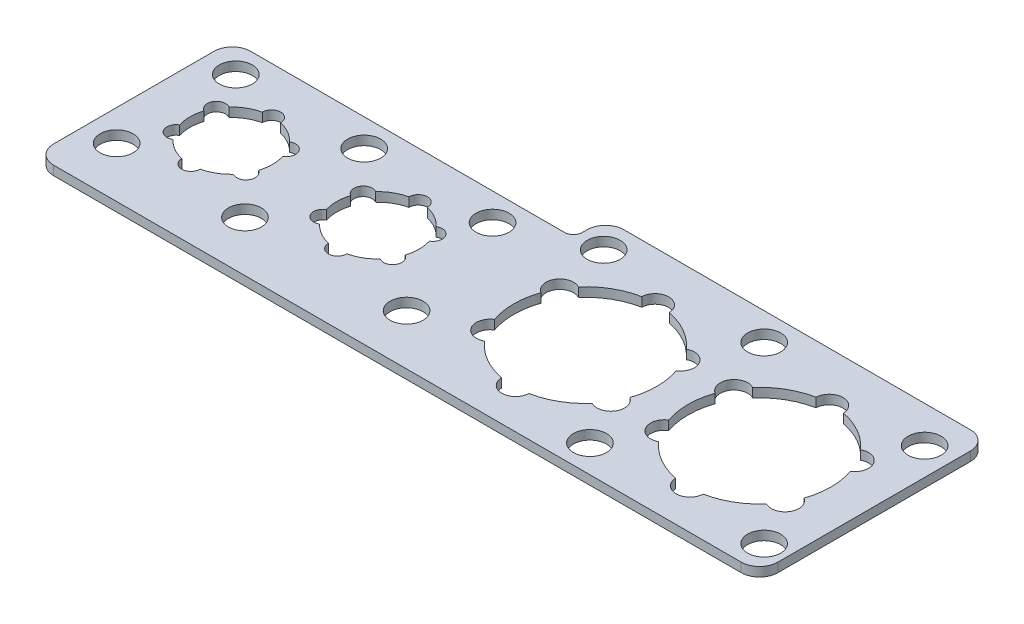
ISO-10303-21;
HEADER;
FILE_DESCRIPTION(('STEP AP214'),'2;1');
FILE_NAME('part.step','',(''),(''),'','','');
FILE_SCHEMA(('AUTOMOTIVE_DESIGN { 1 0 10303 214 1 1 1 1 }'));
ENDSEC;
DATA;
#1=APPLICATION_CONTEXT('core data for automotive mechanical design processes');
#2=APPLICATION_PROTOCOL_DEFINITION('international standard','automotive_design',2000,#1);
#3=PRODUCT_CONTEXT('',#1,'mechanical');
#4=PRODUCT('Part','Part','',(#3));
#5=PRODUCT_RELATED_PRODUCT_CATEGORY('part','',(#4));
#6=PRODUCT_DEFINITION_FORMATION('','',#4);
#7=PRODUCT_DEFINITION_CONTEXT('part definition',#1,'design');
#8=PRODUCT_DEFINITION('design','',#6,#7);
#9=PRODUCT_DEFINITION_SHAPE('','',#8);
#10=(LENGTH_UNIT() NAMED_UNIT(*) SI_UNIT(.MILLI.,.METRE.));
#11=(NAMED_UNIT(*) PLANE_ANGLE_UNIT() SI_UNIT($,.RADIAN.));
#12=(NAMED_UNIT(*) SI_UNIT($,.STERADIAN.) SOLID_ANGLE_UNIT());
#13=UNCERTAINTY_MEASURE_WITH_UNIT(LENGTH_MEASURE(1.E-05),#10,'distance_accuracy_value','');
#14=(GEOMETRIC_REPRESENTATION_CONTEXT(3) GLOBAL_UNCERTAINTY_ASSIGNED_CONTEXT((#13)) GLOBAL_UNIT_ASSIGNED_CONTEXT((#10,
#11,#12)) REPRESENTATION_CONTEXT('',''));
#15=CARTESIAN_POINT('',(0.,0.,0.));
#16=DIRECTION('',(0.,0.,1.));
#17=DIRECTION('',(1.,0.,0.));
#18=AXIS2_PLACEMENT_3D('',#15,#16,#17);
#19=CARTESIAN_POINT('',(0.,-0.5,0.));
#20=DIRECTION('',(0.,-1.,0.));
#21=DIRECTION('',(0.,0.,-1.));
#22=AXIS2_PLACEMENT_3D('',#19,#20,#21);
#23=PLANE('',#22);
#24=CARTESIAN_POINT('',(-18.25,-0.5,-4.75));
#25=DIRECTION('',(0.,1.,0.));
#26=DIRECTION('',(0.,0.,1.));
#27=AXIS2_PLACEMENT_3D('',#24,#25,#26);
#28=CIRCLE('',#27,0.899999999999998);
#29=CARTESIAN_POINT('',(-18.25,-0.5,-3.85));
#30=VERTEX_POINT('',#29);
#31=EDGE_CURVE('E877',#30,#30,#28,.T.);
#32=ORIENTED_EDGE('',*,*,#31,.T.);
#33=EDGE_LOOP('',(#32));
#34=FACE_BOUND('',#33,.T.);
#35=CARTESIAN_POINT('',(-0.25,-0.5,-4.25));
#36=DIRECTION('',(0.,1.,0.));
#37=DIRECTION('',(0.,0.,1.));
#38=AXIS2_PLACEMENT_3D('',#35,#36,#37);
#39=CIRCLE('',#38,0.899999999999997);
#40=CARTESIAN_POINT('',(-0.25,-0.5,-3.35000000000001));
#41=VERTEX_POINT('',#40);
#42=EDGE_CURVE('E885',#41,#41,#39,.T.);
#43=ORIENTED_EDGE('',*,*,#42,.T.);
#44=EDGE_LOOP('',(#43));
#45=FACE_BOUND('',#44,.T.);
#46=CARTESIAN_POINT('',(0.,-0.5,4.75));
#47=DIRECTION('',(0.,1.,0.));
#48=DIRECTION('',(0.,0.,1.));
#49=AXIS2_PLACEMENT_3D('',#46,#47,#48);
#50=CIRCLE('',#49,0.899999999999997);
#51=CARTESIAN_POINT('',(0.,-0.5,5.64999999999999));
#52=VERTEX_POINT('',#51);
#53=EDGE_CURVE('E889',#52,#52,#50,.T.);
#54=ORIENTED_EDGE('',*,*,#53,.T.);
#55=EDGE_LOOP('',(#54));
#56=FACE_BOUND('',#55,.T.);
#57=CARTESIAN_POINT('',(-9.5,-0.5,4.75));
#58=DIRECTION('',(0.,1.,0.));
#59=DIRECTION('',(0.,0.,1.));
#60=AXIS2_PLACEMENT_3D('',#57,#58,#59);
#61=CIRCLE('',#60,0.899999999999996);
#62=CARTESIAN_POINT('',(-9.5,-0.5,5.64999999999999));
#63=VERTEX_POINT('',#62);
#64=EDGE_CURVE('E893',#63,#63,#61,.T.);
#65=ORIENTED_EDGE('',*,*,#64,.T.);
#66=EDGE_LOOP('',(#65));
#67=FACE_BOUND('',#66,.T.);
#68=CARTESIAN_POINT('',(-14.25,-0.5,0.249999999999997));
#69=DIRECTION('',(0.,1.,0.));
#70=DIRECTION('',(0.,0.,1.));
#71=AXIS2_PLACEMENT_3D('',#68,#69,#70);
#72=CIRCLE('',#71,3.9);
#73=CARTESIAN_POINT('',(-11.3102101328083,-0.5,-2.31273984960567));
#74=VERTEX_POINT('',#73);
#75=CARTESIAN_POINT('',(-13.5004971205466,-0.5,-3.57730263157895));
#76=VERTEX_POINT('',#75);
#77=EDGE_CURVE('E1238',#74,#76,#72,.T.);
#78=ORIENTED_EDGE('',*,*,#77,.T.);
#79=CARTESIAN_POINT('',(-14.25,-0.5,-3.55));
#80=DIRECTION('',(0.,-1.,0.));
#81=DIRECTION('',(0.,0.,-1.));
#82=AXIS2_PLACEMENT_3D('',#79,#80,#81);
#83=CIRCLE('',#82,0.75);
#84=CARTESIAN_POINT('',(-14.9995028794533,-0.5,-3.57730263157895));
#85=VERTEX_POINT('',#84);
#86=EDGE_CURVE('E816',#85,#76,#83,.T.);
#87=ORIENTED_EDGE('',*,*,#86,.F.);
#88=CARTESIAN_POINT('',(-17.1897898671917,-0.5,-2.31273984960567));
#89=VERTEX_POINT('',#88);
#90=EDGE_CURVE('E902',#85,#89,#72,.T.);
#91=ORIENTED_EDGE('',*,*,#90,.T.);
#92=CARTESIAN_POINT('',(-17.5408965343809,-0.5,-1.65));
#93=DIRECTION('',(0.,-1.,0.));
#94=DIRECTION('',(0.,0.,-1.));
#95=AXIS2_PLACEMENT_3D('',#92,#93,#94);
#96=CIRCLE('',#95,0.750000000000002);
#97=CARTESIAN_POINT('',(-17.9392927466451,-0.5,-1.01456278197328));
#98=VERTEX_POINT('',#97);
#99=EDGE_CURVE('E854',#98,#89,#96,.T.);
#100=ORIENTED_EDGE('',*,*,#99,.F.);
#101=CARTESIAN_POINT('',(-17.9392927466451,-0.5,1.51456278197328));
#102=VERTEX_POINT('',#101);
#103=EDGE_CURVE('E897',#98,#102,#72,.T.);
#104=ORIENTED_EDGE('',*,*,#103,.T.);
#105=CARTESIAN_POINT('',(-17.5408965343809,-0.5,2.15));
#106=DIRECTION('',(0.,-1.,0.));
#107=DIRECTION('',(0.,0.,-1.));
#108=AXIS2_PLACEMENT_3D('',#105,#106,#107);
#109=CIRCLE('',#108,0.750000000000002);
#110=CARTESIAN_POINT('',(-17.1897898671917,-0.5,2.81273984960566));
#111=VERTEX_POINT('',#110);
#112=EDGE_CURVE('E849',#111,#102,#109,.T.);
#113=ORIENTED_EDGE('',*,*,#112,.F.);
#114=CARTESIAN_POINT('',(-14.9995028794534,-0.5,4.07730263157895));
#115=VERTEX_POINT('',#114);
#116=EDGE_CURVE('E901',#111,#115,#72,.T.);
#117=ORIENTED_EDGE('',*,*,#116,.T.);
#118=CARTESIAN_POINT('',(-14.25,-0.5,4.05));
#119=DIRECTION('',(0.,-1.,0.));
#120=DIRECTION('',(0.,0.,-1.));
#121=AXIS2_PLACEMENT_3D('',#118,#119,#120);
#122=CIRCLE('',#121,0.75);
#123=CARTESIAN_POINT('',(-13.5004971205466,-0.5,4.07730263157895));
#124=VERTEX_POINT('',#123);
#125=EDGE_CURVE('E826',#124,#115,#122,.T.);
#126=ORIENTED_EDGE('',*,*,#125,.F.);
#127=CARTESIAN_POINT('',(-11.3102101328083,-0.5,2.81273984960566));
#128=VERTEX_POINT('',#127);
#129=EDGE_CURVE('E1234',#124,#128,#72,.T.);
#130=ORIENTED_EDGE('',*,*,#129,.T.);
#131=CARTESIAN_POINT('',(-10.9591034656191,-0.5,2.15));
#132=DIRECTION('',(0.,-1.,0.));
#133=DIRECTION('',(0.,0.,-1.));
#134=AXIS2_PLACEMENT_3D('',#131,#132,#133);
#135=CIRCLE('',#134,0.749999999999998);
#136=CARTESIAN_POINT('',(-10.5607072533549,-0.5,1.51456278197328));
#137=VERTEX_POINT('',#136);
#138=EDGE_CURVE('E821',#137,#128,#135,.T.);
#139=ORIENTED_EDGE('',*,*,#138,.F.);
#140=CARTESIAN_POINT('',(-10.5607072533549,-0.5,-1.01456278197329));
#141=VERTEX_POINT('',#140);
#142=EDGE_CURVE('E1236',#137,#141,#72,.T.);
#143=ORIENTED_EDGE('',*,*,#142,.T.);
#144=CARTESIAN_POINT('',(-10.9591034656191,-0.5,-1.65));
#145=DIRECTION('',(0.,-1.,0.));
#146=DIRECTION('',(0.,0.,-1.));
#147=AXIS2_PLACEMENT_3D('',#144,#145,#146);
#148=CIRCLE('',#147,0.749999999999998);
#149=EDGE_CURVE('E833',#74,#141,#148,.T.);
#150=ORIENTED_EDGE('',*,*,#149,.F.);
#151=EDGE_LOOP('',(#78,#87,#91,#100,#104,#113,#117,#126,#130,#139,#143,#150));
#152=FACE_BOUND('',#151,.T.);
#153=CARTESIAN_POINT('',(-4.75,-0.5,0.249999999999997));
#154=DIRECTION('',(0.,1.,0.));
#155=DIRECTION('',(0.,0.,1.));
#156=AXIS2_PLACEMENT_3D('',#153,#154,#155);
#157=CIRCLE('',#156,3.9);
#158=CARTESIAN_POINT('',(-1.06070725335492,-0.5,1.51456278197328));
#159=VERTEX_POINT('',#158);
#160=CARTESIAN_POINT('',(-1.06070725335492,-0.5,-1.01456278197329));
#161=VERTEX_POINT('',#160);
#162=EDGE_CURVE('E1856',#159,#161,#157,.T.);
#163=ORIENTED_EDGE('',*,*,#162,.T.);
#164=CARTESIAN_POINT('',(-1.45910346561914,-0.5,-1.65));
#165=DIRECTION('',(0.,-1.,0.));
#166=DIRECTION('',(0.,0.,-1.));
#167=AXIS2_PLACEMENT_3D('',#164,#165,#166);
#168=CIRCLE('',#167,0.749999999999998);
#169=CARTESIAN_POINT('',(-1.81021013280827,-0.5,-2.31273984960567));
#170=VERTEX_POINT('',#169);
#171=EDGE_CURVE('E754',#170,#161,#168,.T.);
#172=ORIENTED_EDGE('',*,*,#171,.F.);
#173=CARTESIAN_POINT('',(-4.00049712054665,-0.5,-3.57730263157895));
#174=VERTEX_POINT('',#173);
#175=EDGE_CURVE('E911',#170,#174,#157,.T.);
#176=ORIENTED_EDGE('',*,*,#175,.T.);
#177=CARTESIAN_POINT('',(-4.75,-0.5,-3.55));
#178=DIRECTION('',(0.,-1.,0.));
#179=DIRECTION('',(0.,0.,-1.));
#180=AXIS2_PLACEMENT_3D('',#177,#178,#179);
#181=CIRCLE('',#180,0.75);
#182=CARTESIAN_POINT('',(-5.49950287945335,-0.5,-3.57730263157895));
#183=VERTEX_POINT('',#182);
#184=EDGE_CURVE('E804',#183,#174,#181,.T.);
#185=ORIENTED_EDGE('',*,*,#184,.F.);
#186=CARTESIAN_POINT('',(-7.68978986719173,-0.5,-2.31273984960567));
#187=VERTEX_POINT('',#186);
#188=EDGE_CURVE('E907',#183,#187,#157,.T.);
#189=ORIENTED_EDGE('',*,*,#188,.T.);
#190=CARTESIAN_POINT('',(-8.04089653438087,-0.5,-1.65));
#191=DIRECTION('',(0.,-1.,0.));
#192=DIRECTION('',(0.,0.,-1.));
#193=AXIS2_PLACEMENT_3D('',#190,#191,#192);
#194=CIRCLE('',#193,0.750000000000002);
#195=CARTESIAN_POINT('',(-8.43929274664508,-0.5,-1.01456278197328));
#196=VERTEX_POINT('',#195);
#197=EDGE_CURVE('E794',#196,#187,#194,.T.);
#198=ORIENTED_EDGE('',*,*,#197,.F.);
#199=CARTESIAN_POINT('',(-8.43929274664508,-0.5,1.51456278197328));
#200=VERTEX_POINT('',#199);
#201=EDGE_CURVE('E910',#196,#200,#157,.T.);
#202=ORIENTED_EDGE('',*,*,#201,.T.);
#203=CARTESIAN_POINT('',(-8.04089653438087,-0.5,2.15));
#204=DIRECTION('',(0.,-1.,0.));
#205=DIRECTION('',(0.,0.,-1.));
#206=AXIS2_PLACEMENT_3D('',#203,#204,#205);
#207=CIRCLE('',#206,0.750000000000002);
#208=CARTESIAN_POINT('',(-7.68978986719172,-0.5,2.81273984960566));
#209=VERTEX_POINT('',#208);
#210=EDGE_CURVE('E784',#209,#200,#207,.T.);
#211=ORIENTED_EDGE('',*,*,#210,.F.);
#212=CARTESIAN_POINT('',(-5.49950287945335,-0.5,4.07730263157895));
#213=VERTEX_POINT('',#212);
#214=EDGE_CURVE('E1852',#209,#213,#157,.T.);
#215=ORIENTED_EDGE('',*,*,#214,.T.);
#216=CARTESIAN_POINT('',(-4.75,-0.5,4.05));
#217=DIRECTION('',(0.,-1.,0.));
#218=DIRECTION('',(0.,0.,-1.));
#219=AXIS2_PLACEMENT_3D('',#216,#217,#218);
#220=CIRCLE('',#219,0.75);
#221=CARTESIAN_POINT('',(-4.00049712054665,-0.5,4.07730263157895));
#222=VERTEX_POINT('',#221);
#223=EDGE_CURVE('E774',#222,#213,#220,.T.);
#224=ORIENTED_EDGE('',*,*,#223,.F.);
#225=CARTESIAN_POINT('',(-1.81021013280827,-0.5,2.81273984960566));
#226=VERTEX_POINT('',#225);
#227=EDGE_CURVE('E1853',#222,#226,#157,.T.);
#228=ORIENTED_EDGE('',*,*,#227,.T.);
#229=CARTESIAN_POINT('',(-1.45910346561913,-0.5,2.15));
#230=DIRECTION('',(0.,-1.,0.));
#231=DIRECTION('',(0.,0.,-1.));
#232=AXIS2_PLACEMENT_3D('',#229,#230,#231);
#233=CIRCLE('',#232,0.749999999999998);
#234=EDGE_CURVE('E764',#159,#226,#233,.T.);
#235=ORIENTED_EDGE('',*,*,#234,.F.);
#236=EDGE_LOOP('',(#163,#172,#176,#185,#189,#198,#202,#211,#215,#224,#228,#235));
#237=FACE_BOUND('',#236,.T.);
#238=CARTESIAN_POINT('',(-9.5,-0.5,-4.75000000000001));
#239=DIRECTION('',(0.,1.,0.));
#240=DIRECTION('',(0.,0.,1.));
#241=AXIS2_PLACEMENT_3D('',#238,#239,#240);
#242=CIRCLE('',#241,0.899999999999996);
#243=CARTESIAN_POINT('',(-9.5,-0.5,-3.85000000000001));
#244=VERTEX_POINT('',#243);
#245=EDGE_CURVE('E881',#244,#244,#242,.T.);
#246=ORIENTED_EDGE('',*,*,#245,.T.);
#247=EDGE_LOOP('',(#246));
#248=FACE_BOUND('',#247,.T.);
#249=DIRECTION('',(0.,0.,1.));
#250=VECTOR('',#249,1.);
#251=CARTESIAN_POINT('',(-19.65,-0.5,-6.25));
#252=LINE('',#251,#250);
#253=CARTESIAN_POINT('',(-19.65,-0.5,-5.25));
#254=VERTEX_POINT('',#253);
#255=CARTESIAN_POINT('',(-19.65,-0.5,-5.));
#256=VERTEX_POINT('',#255);
#257=EDGE_CURVE('E632',#254,#256,#252,.T.);
#258=ORIENTED_EDGE('',*,*,#257,.F.);
#259=CARTESIAN_POINT('',(-18.65,-0.5,-5.25));
#260=DIRECTION('',(0.,-1.,0.));
#261=DIRECTION('',(0.,0.,-1.));
#262=AXIS2_PLACEMENT_3D('',#259,#260,#261);
#263=CIRCLE('',#262,1.);
#264=CARTESIAN_POINT('',(-18.65,-0.5,-6.25));
#265=VERTEX_POINT('',#264);
#266=EDGE_CURVE('E966',#254,#265,#263,.T.);
#267=ORIENTED_EDGE('',*,*,#266,.T.);
#268=DIRECTION('',(-1.,0.,0.));
#269=VECTOR('',#268,1.);
#270=CARTESIAN_POINT('',(-19.25,-0.5,-6.25));
#271=LINE('',#270,#269);
#272=CARTESIAN_POINT('',(0.249999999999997,-0.5,-6.25));
#273=VERTEX_POINT('',#272);
#274=EDGE_CURVE('E916',#273,#265,#271,.T.);
#275=ORIENTED_EDGE('',*,*,#274,.F.);
#276=CARTESIAN_POINT('',(0.249999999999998,-0.5,-5.25));
#277=DIRECTION('',(0.,-1.,0.));
#278=DIRECTION('',(0.,0.,-1.));
#279=AXIS2_PLACEMENT_3D('',#276,#277,#278);
#280=CIRCLE('',#279,1.);
#281=CARTESIAN_POINT('',(1.25,-0.5,-5.25));
#282=VERTEX_POINT('',#281);
#283=EDGE_CURVE('E942',#273,#282,#280,.T.);
#284=ORIENTED_EDGE('',*,*,#283,.T.);
#285=DIRECTION('',(0.,0.,1.));
#286=VECTOR('',#285,1.);
#287=CARTESIAN_POINT('',(1.25,-0.5,-6.25));
#288=LINE('',#287,#286);
#289=CARTESIAN_POINT('',(1.25,-0.5,5.25));
#290=VERTEX_POINT('',#289);
#291=EDGE_CURVE('E751',#282,#290,#288,.T.);
#292=ORIENTED_EDGE('',*,*,#291,.T.);
#293=CARTESIAN_POINT('',(0.25,-0.5,5.25));
#294=DIRECTION('',(0.,-1.,0.));
#295=DIRECTION('',(0.,0.,-1.));
#296=AXIS2_PLACEMENT_3D('',#293,#294,#295);
#297=CIRCLE('',#296,1.);
#298=CARTESIAN_POINT('',(0.25,-0.5,6.25));
#299=VERTEX_POINT('',#298);
#300=EDGE_CURVE('E944',#290,#299,#297,.T.);
#301=ORIENTED_EDGE('',*,*,#300,.T.);
#302=DIRECTION('',(1.,0.,0.));
#303=VECTOR('',#302,1.);
#304=CARTESIAN_POINT('',(-19.25,-0.5,6.25));
#305=LINE('',#304,#303);
#306=CARTESIAN_POINT('',(-37.25,-0.5,6.25));
#307=VERTEX_POINT('',#306);
#308=EDGE_CURVE('E919',#307,#299,#305,.T.);
#309=ORIENTED_EDGE('',*,*,#308,.F.);
#310=CARTESIAN_POINT('',(-37.25,-0.5,5.25));
#311=DIRECTION('',(0.,-1.,0.));
#312=DIRECTION('',(0.,0.,-1.));
#313=AXIS2_PLACEMENT_3D('',#310,#311,#312);
#314=CIRCLE('',#313,1.);
#315=CARTESIAN_POINT('',(-38.25,-0.5,5.25));
#316=VERTEX_POINT('',#315);
#317=EDGE_CURVE('E946',#307,#316,#314,.T.);
#318=ORIENTED_EDGE('',*,*,#317,.T.);
#319=DIRECTION('',(0.,0.,1.));
#320=VECTOR('',#319,1.);
#321=CARTESIAN_POINT('',(-38.25,-0.5,-4.5));
#322=LINE('',#321,#320);
#323=CARTESIAN_POINT('',(-38.25,-0.5,-3.5));
#324=VERTEX_POINT('',#323);
#325=EDGE_CURVE('E747',#324,#316,#322,.T.);
#326=ORIENTED_EDGE('',*,*,#325,.F.);
#327=CARTESIAN_POINT('',(-37.25,-0.5,-3.5));
#328=DIRECTION('',(0.,-1.,0.));
#329=DIRECTION('',(0.,0.,-1.));
#330=AXIS2_PLACEMENT_3D('',#327,#328,#329);
#331=CIRCLE('',#330,1.);
#332=CARTESIAN_POINT('',(-37.25,-0.5,-4.5));
#333=VERTEX_POINT('',#332);
#334=EDGE_CURVE('E948',#324,#333,#331,.T.);
#335=ORIENTED_EDGE('',*,*,#334,.T.);
#336=DIRECTION('',(-1.,0.,0.));
#337=VECTOR('',#336,1.);
#338=CARTESIAN_POINT('',(-19.25,-0.5,-4.5));
#339=LINE('',#338,#337);
#340=CARTESIAN_POINT('',(-20.15,-0.5,-4.5));
#341=VERTEX_POINT('',#340);
#342=EDGE_CURVE('E744',#341,#333,#339,.T.);
#343=ORIENTED_EDGE('',*,*,#342,.F.);
#344=CARTESIAN_POINT('',(-20.15,-0.5,-5.));
#345=DIRECTION('',(0.,-1.,0.));
#346=DIRECTION('',(0.,0.,-1.));
#347=AXIS2_PLACEMENT_3D('',#344,#345,#346);
#348=CIRCLE('',#347,0.5);
#349=EDGE_CURVE('E11',#341,#256,#348,.F.);
#350=ORIENTED_EDGE('',*,*,#349,.T.);
#351=EDGE_LOOP('',(#258,#267,#275,#284,#292,#301,#309,#318,#326,#335,#343,#350));
#352=FACE_BOUND('',#351,.T.);
#353=CARTESIAN_POINT('',(-36.5614,-0.5,-3.));
#354=DIRECTION('',(0.,-1.,0.));
#355=DIRECTION('',(0.,0.,-1.));
#356=AXIS2_PLACEMENT_3D('',#353,#354,#355);
#357=CIRCLE('',#356,0.899999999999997);
#358=CARTESIAN_POINT('',(-36.5614,-0.5,-3.9));
#359=VERTEX_POINT('',#358);
#360=EDGE_CURVE('E737',#359,#359,#357,.T.);
#361=ORIENTED_EDGE('',*,*,#360,.F.);
#362=EDGE_LOOP('',(#361));
#363=FACE_BOUND('',#362,.T.);
#364=CARTESIAN_POINT('',(-36.5614,-0.5,3.5));
#365=DIRECTION('',(0.,-1.,0.));
#366=DIRECTION('',(0.,0.,-1.));
#367=AXIS2_PLACEMENT_3D('',#364,#365,#366);
#368=CIRCLE('',#367,0.900000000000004);
#369=CARTESIAN_POINT('',(-36.5614,-0.5,2.59999999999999));
#370=VERTEX_POINT('',#369);
#371=EDGE_CURVE('E567',#370,#370,#368,.T.);
#372=ORIENTED_EDGE('',*,*,#371,.F.);
#373=EDGE_LOOP('',(#372));
#374=FACE_BOUND('',#373,.T.);
#375=CARTESIAN_POINT('',(-29.5614,-0.5,3.5));
#376=DIRECTION('',(0.,-1.,0.));
#377=DIRECTION('',(0.,0.,-1.));
#378=AXIS2_PLACEMENT_3D('',#375,#376,#377);
#379=CIRCLE('',#378,0.9);
#380=CARTESIAN_POINT('',(-29.5614,-0.5,2.6));
#381=VERTEX_POINT('',#380);
#382=EDGE_CURVE('E562',#381,#381,#379,.T.);
#383=ORIENTED_EDGE('',*,*,#382,.F.);
#384=EDGE_LOOP('',(#383));
#385=FACE_BOUND('',#384,.T.);
#386=CARTESIAN_POINT('',(-29.5614,-0.5,-3.));
#387=DIRECTION('',(0.,-1.,0.));
#388=DIRECTION('',(0.,0.,-1.));
#389=AXIS2_PLACEMENT_3D('',#386,#387,#388);
#390=CIRCLE('',#389,0.9);
#391=CARTESIAN_POINT('',(-29.5614,-0.5,-3.9));
#392=VERTEX_POINT('',#391);
#393=EDGE_CURVE('E558',#392,#392,#390,.T.);
#394=ORIENTED_EDGE('',*,*,#393,.F.);
#395=EDGE_LOOP('',(#394));
#396=FACE_BOUND('',#395,.T.);
#397=CARTESIAN_POINT('',(-22.5614,-0.5,-3.));
#398=DIRECTION('',(0.,-1.,0.));
#399=DIRECTION('',(0.,0.,-1.));
#400=AXIS2_PLACEMENT_3D('',#397,#398,#399);
#401=CIRCLE('',#400,0.9);
#402=CARTESIAN_POINT('',(-22.5614,-0.5,-3.90000000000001));
#403=VERTEX_POINT('',#402);
#404=EDGE_CURVE('E554',#403,#403,#401,.T.);
#405=ORIENTED_EDGE('',*,*,#404,.F.);
#406=EDGE_LOOP('',(#405));
#407=FACE_BOUND('',#406,.T.);
#408=CARTESIAN_POINT('',(-33.5614,-0.5,0.249999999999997));
#409=DIRECTION('',(0.,-1.,0.));
#410=DIRECTION('',(0.,0.,-1.));
#411=AXIS2_PLACEMENT_3D('',#408,#409,#410);
#412=CIRCLE('',#411,2.25);
#413=CARTESIAN_POINT('',(-33.061439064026,-0.5,-1.94375000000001));
#414=VERTEX_POINT('',#413);
#415=CARTESIAN_POINT('',(-31.9115372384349,-0.5,-1.27985387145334));
#416=VERTEX_POINT('',#415);
#417=EDGE_CURVE('E546',#414,#416,#412,.T.);
#418=ORIENTED_EDGE('',*,*,#417,.F.);
#419=CARTESIAN_POINT('',(-33.5614,-0.5,-1.95));
#420=DIRECTION('',(0.,-1.,0.));
#421=DIRECTION('',(0.,0.,-1.));
#422=AXIS2_PLACEMENT_3D('',#419,#420,#421);
#423=CIRCLE('',#422,0.499999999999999);
#424=CARTESIAN_POINT('',(-34.061360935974,-0.5,-1.94375000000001));
#425=VERTEX_POINT('',#424);
#426=EDGE_CURVE('E638',#425,#414,#423,.T.);
#427=ORIENTED_EDGE('',*,*,#426,.F.);
#428=CARTESIAN_POINT('',(-35.2112627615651,-0.5,-1.27985387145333));
#429=VERTEX_POINT('',#428);
#430=EDGE_CURVE('E553',#429,#425,#412,.T.);
#431=ORIENTED_EDGE('',*,*,#430,.F.);
#432=CARTESIAN_POINT('',(-35.4666558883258,-0.5,-0.85));
#433=DIRECTION('',(0.,-1.,0.));
#434=DIRECTION('',(0.,0.,-1.));
#435=AXIS2_PLACEMENT_3D('',#432,#433,#434);
#436=CIRCLE('',#435,0.499999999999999);
#437=CARTESIAN_POINT('',(-35.7112236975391,-0.5,-0.413896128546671));
#438=VERTEX_POINT('',#437);
#439=EDGE_CURVE('E696',#438,#429,#436,.T.);
#440=ORIENTED_EDGE('',*,*,#439,.F.);
#441=CARTESIAN_POINT('',(-35.7112236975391,-0.5,0.913896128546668));
#442=VERTEX_POINT('',#441);
#443=EDGE_CURVE('E556',#442,#438,#412,.T.);
#444=ORIENTED_EDGE('',*,*,#443,.F.);
#445=CARTESIAN_POINT('',(-35.4666558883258,-0.5,1.35));
#446=DIRECTION('',(0.,-1.,0.));
#447=DIRECTION('',(0.,0.,-1.));
#448=AXIS2_PLACEMENT_3D('',#445,#446,#447);
#449=CIRCLE('',#448,0.499999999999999);
#450=CARTESIAN_POINT('',(-35.2112627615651,-0.5,1.77985387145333));
#451=VERTEX_POINT('',#450);
#452=EDGE_CURVE('E687',#451,#442,#449,.T.);
#453=ORIENTED_EDGE('',*,*,#452,.F.);
#454=CARTESIAN_POINT('',(-34.061360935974,-0.5,2.44375));
#455=VERTEX_POINT('',#454);
#456=EDGE_CURVE('E551',#455,#451,#412,.T.);
#457=ORIENTED_EDGE('',*,*,#456,.F.);
#458=CARTESIAN_POINT('',(-33.5614,-0.5,2.45));
#459=DIRECTION('',(0.,-1.,0.));
#460=DIRECTION('',(0.,0.,-1.));
#461=AXIS2_PLACEMENT_3D('',#458,#459,#460);
#462=CIRCLE('',#461,0.499999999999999);
#463=CARTESIAN_POINT('',(-33.061439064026,-0.5,2.44375));
#464=VERTEX_POINT('',#463);
#465=EDGE_CURVE('E527',#464,#455,#462,.T.);
#466=ORIENTED_EDGE('',*,*,#465,.F.);
#467=CARTESIAN_POINT('',(-31.9115372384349,-0.5,1.77985387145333));
#468=VERTEX_POINT('',#467);
#469=EDGE_CURVE('E544',#468,#464,#412,.T.);
#470=ORIENTED_EDGE('',*,*,#469,.F.);
#471=CARTESIAN_POINT('',(-31.6561441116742,-0.5,1.34999999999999));
#472=DIRECTION('',(0.,-1.,0.));
#473=DIRECTION('',(0.,0.,-1.));
#474=AXIS2_PLACEMENT_3D('',#471,#472,#473);
#475=CIRCLE('',#474,0.499999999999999);
#476=CARTESIAN_POINT('',(-31.4115763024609,-0.5,0.91389612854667));
#477=VERTEX_POINT('',#476);
#478=EDGE_CURVE('E516',#477,#468,#475,.T.);
#479=ORIENTED_EDGE('',*,*,#478,.F.);
#480=CARTESIAN_POINT('',(-31.4115763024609,-0.5,-0.413896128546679));
#481=VERTEX_POINT('',#480);
#482=EDGE_CURVE('E540',#481,#477,#412,.T.);
#483=ORIENTED_EDGE('',*,*,#482,.F.);
#484=CARTESIAN_POINT('',(-31.6561441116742,-0.5,-0.850000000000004));
#485=DIRECTION('',(0.,-1.,0.));
#486=DIRECTION('',(0.,0.,-1.));
#487=AXIS2_PLACEMENT_3D('',#484,#485,#486);
#488=CIRCLE('',#487,0.499999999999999);
#489=EDGE_CURVE('E468',#416,#481,#488,.T.);
#490=ORIENTED_EDGE('',*,*,#489,.F.);
#491=EDGE_LOOP('',(#418,#427,#431,#440,#444,#453,#457,#466,#470,#479,#483,#490));
#492=FACE_BOUND('',#491,.T.);
#493=CARTESIAN_POINT('',(-25.5614,-0.5,0.249999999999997));
#494=DIRECTION('',(0.,-1.,0.));
#495=DIRECTION('',(0.,0.,-1.));
#496=AXIS2_PLACEMENT_3D('',#493,#494,#495);
#497=CIRCLE('',#496,2.25);
#498=CARTESIAN_POINT('',(-27.2112627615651,-0.5,-1.27985387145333));
#499=VERTEX_POINT('',#498);
#500=CARTESIAN_POINT('',(-26.061360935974,-0.5,-1.94375000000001));
#501=VERTEX_POINT('',#500);
#502=EDGE_CURVE('E543',#499,#501,#497,.T.);
#503=ORIENTED_EDGE('',*,*,#502,.F.);
#504=CARTESIAN_POINT('',(-27.4666558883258,-0.5,-0.85));
#505=DIRECTION('',(0.,-1.,0.));
#506=DIRECTION('',(0.,0.,-1.));
#507=AXIS2_PLACEMENT_3D('',#504,#505,#506);
#508=CIRCLE('',#507,0.499999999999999);
#509=CARTESIAN_POINT('',(-27.7112236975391,-0.5,-0.413896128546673));
#510=VERTEX_POINT('',#509);
#511=EDGE_CURVE('E661',#510,#499,#508,.T.);
#512=ORIENTED_EDGE('',*,*,#511,.F.);
#513=CARTESIAN_POINT('',(-27.7112236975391,-0.5,0.913896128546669));
#514=VERTEX_POINT('',#513);
#515=EDGE_CURVE('E548',#514,#510,#497,.T.);
#516=ORIENTED_EDGE('',*,*,#515,.F.);
#517=CARTESIAN_POINT('',(-27.4666558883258,-0.5,1.35));
#518=DIRECTION('',(0.,-1.,0.));
#519=DIRECTION('',(0.,0.,-1.));
#520=AXIS2_PLACEMENT_3D('',#517,#518,#519);
#521=CIRCLE('',#520,0.499999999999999);
#522=CARTESIAN_POINT('',(-27.2112627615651,-0.5,1.77985387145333));
#523=VERTEX_POINT('',#522);
#524=EDGE_CURVE('E673',#523,#514,#521,.T.);
#525=ORIENTED_EDGE('',*,*,#524,.F.);
#526=CARTESIAN_POINT('',(-26.061360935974,-0.5,2.44375));
#527=VERTEX_POINT('',#526);
#528=EDGE_CURVE('E733',#527,#523,#497,.T.);
#529=ORIENTED_EDGE('',*,*,#528,.F.);
#530=CARTESIAN_POINT('',(-25.5614,-0.5,2.45));
#531=DIRECTION('',(0.,-1.,0.));
#532=DIRECTION('',(0.,0.,-1.));
#533=AXIS2_PLACEMENT_3D('',#530,#531,#532);
#534=CIRCLE('',#533,0.499999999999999);
#535=CARTESIAN_POINT('',(-25.061439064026,-0.5,2.44375));
#536=VERTEX_POINT('',#535);
#537=EDGE_CURVE('E423',#536,#527,#534,.T.);
#538=ORIENTED_EDGE('',*,*,#537,.F.);
#539=CARTESIAN_POINT('',(-23.9115372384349,-0.5,1.77985387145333));
#540=VERTEX_POINT('',#539);
#541=EDGE_CURVE('E731',#540,#536,#497,.T.);
#542=ORIENTED_EDGE('',*,*,#541,.F.);
#543=CARTESIAN_POINT('',(-23.6561441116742,-0.5,1.34999999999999));
#544=DIRECTION('',(0.,-1.,0.));
#545=DIRECTION('',(0.,0.,-1.));
#546=AXIS2_PLACEMENT_3D('',#543,#544,#545);
#547=CIRCLE('',#546,0.499999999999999);
#548=CARTESIAN_POINT('',(-23.4115763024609,-0.5,0.913896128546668));
#549=VERTEX_POINT('',#548);
#550=EDGE_CURVE('E418',#549,#540,#547,.T.);
#551=ORIENTED_EDGE('',*,*,#550,.F.);
#552=CARTESIAN_POINT('',(-23.4115763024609,-0.5,-0.413896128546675));
#553=VERTEX_POINT('',#552);
#554=EDGE_CURVE('E727',#553,#549,#497,.T.);
#555=ORIENTED_EDGE('',*,*,#554,.F.);
#556=CARTESIAN_POINT('',(-23.6561441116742,-0.5,-0.850000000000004));
#557=DIRECTION('',(0.,-1.,0.));
#558=DIRECTION('',(0.,0.,-1.));
#559=AXIS2_PLACEMENT_3D('',#556,#557,#558);
#560=CIRCLE('',#559,0.499999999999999);
#561=CARTESIAN_POINT('',(-23.9115372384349,-0.5,-1.27985387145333));
#562=VERTEX_POINT('',#561);
#563=EDGE_CURVE('E646',#562,#553,#560,.T.);
#564=ORIENTED_EDGE('',*,*,#563,.F.);
#565=CARTESIAN_POINT('',(-25.061439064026,-0.5,-1.94375000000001));
#566=VERTEX_POINT('',#565);
#567=EDGE_CURVE('E550',#566,#562,#497,.T.);
#568=ORIENTED_EDGE('',*,*,#567,.F.);
#569=CARTESIAN_POINT('',(-25.5614,-0.5,-1.95));
#570=DIRECTION('',(0.,-1.,0.));
#571=DIRECTION('',(0.,0.,-1.));
#572=AXIS2_PLACEMENT_3D('',#569,#570,#571);
#573=CIRCLE('',#572,0.499999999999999);
#574=EDGE_CURVE('E666',#501,#566,#573,.T.);
#575=ORIENTED_EDGE('',*,*,#574,.F.);
#576=EDGE_LOOP('',(#503,#512,#516,#525,#529,#538,#542,#551,#555,#564,#568,#575));
#577=FACE_BOUND('',#576,.T.);
#578=CARTESIAN_POINT('',(-20.75,-0.5,3.5));
#579=DIRECTION('',(0.,1.,0.));
#580=DIRECTION('',(0.,0.,1.));
#581=AXIS2_PLACEMENT_3D('',#578,#579,#580);
#582=CIRCLE('',#581,0.899999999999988);
#583=CARTESIAN_POINT('',(-20.75,-0.5,4.39999999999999));
#584=VERTEX_POINT('',#583);
#585=EDGE_CURVE('E629',#584,#584,#582,.T.);
#586=ORIENTED_EDGE('',*,*,#585,.T.);
#587=EDGE_LOOP('',(#586));
#588=FACE_BOUND('',#587,.T.);
#589=ADVANCED_FACE('F38',(#34,#45,#56,#67,#152,#237,#248,#352,#363,#374,#385,#396,#407,#492,
#577,#588),#23,.T.);
#590=CARTESIAN_POINT('',(0.,0.,0.));
#591=DIRECTION('',(0.,-1.,0.));
#592=DIRECTION('',(0.,0.,-1.));
#593=AXIS2_PLACEMENT_3D('',#590,#591,#592);
#594=PLANE('',#593);
#595=CARTESIAN_POINT('',(-27.4666558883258,0.,-0.85));
#596=DIRECTION('',(0.,-1.,0.));
#597=DIRECTION('',(0.,0.,-1.));
#598=AXIS2_PLACEMENT_3D('',#595,#596,#597);
#599=CIRCLE('',#598,0.499999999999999);
#600=CARTESIAN_POINT('',(-27.7112236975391,0.,-0.413896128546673));
#601=VERTEX_POINT('',#600);
#602=CARTESIAN_POINT('',(-27.2112627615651,0.,-1.27985387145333));
#603=VERTEX_POINT('',#602);
#604=EDGE_CURVE('E658',#601,#603,#599,.T.);
#605=ORIENTED_EDGE('',*,*,#604,.T.);
#606=CARTESIAN_POINT('',(-25.5614,0.,0.249999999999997));
#607=DIRECTION('',(0.,1.,0.));
#608=DIRECTION('',(0.,0.,1.));
#609=AXIS2_PLACEMENT_3D('',#606,#607,#608);
#610=CIRCLE('',#609,2.25);
#611=CARTESIAN_POINT('',(-26.061360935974,0.,-1.94375000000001));
#612=VERTEX_POINT('',#611);
#613=EDGE_CURVE('E457',#612,#603,#610,.T.);
#614=ORIENTED_EDGE('',*,*,#613,.F.);
#615=CARTESIAN_POINT('',(-25.5614,0.,-1.95));
#616=DIRECTION('',(0.,-1.,0.));
#617=DIRECTION('',(0.,0.,-1.));
#618=AXIS2_PLACEMENT_3D('',#615,#616,#617);
#619=CIRCLE('',#618,0.499999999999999);
#620=CARTESIAN_POINT('',(-25.061439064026,0.,-1.94375000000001));
#621=VERTEX_POINT('',#620);
#622=EDGE_CURVE('E701',#612,#621,#619,.T.);
#623=ORIENTED_EDGE('',*,*,#622,.T.);
#624=CARTESIAN_POINT('',(-23.9115372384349,0.,-1.27985387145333));
#625=VERTEX_POINT('',#624);
#626=EDGE_CURVE('E447',#625,#621,#610,.T.);
#627=ORIENTED_EDGE('',*,*,#626,.F.);
#628=CARTESIAN_POINT('',(-23.6561441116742,0.,-0.850000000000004));
#629=DIRECTION('',(0.,-1.,0.));
#630=DIRECTION('',(0.,0.,-1.));
#631=AXIS2_PLACEMENT_3D('',#628,#629,#630);
#632=CIRCLE('',#631,0.499999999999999);
#633=CARTESIAN_POINT('',(-23.4115763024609,0.,-0.413896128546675));
#634=VERTEX_POINT('',#633);
#635=EDGE_CURVE('E643',#625,#634,#632,.T.);
#636=ORIENTED_EDGE('',*,*,#635,.T.);
#637=CARTESIAN_POINT('',(-23.4115763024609,0.,0.913896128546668));
#638=VERTEX_POINT('',#637);
#639=EDGE_CURVE('E436',#638,#634,#610,.T.);
#640=ORIENTED_EDGE('',*,*,#639,.F.);
#641=CARTESIAN_POINT('',(-23.6561441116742,0.,1.34999999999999));
#642=DIRECTION('',(0.,-1.,0.));
#643=DIRECTION('',(0.,0.,-1.));
#644=AXIS2_PLACEMENT_3D('',#641,#642,#643);
#645=CIRCLE('',#644,0.499999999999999);
#646=CARTESIAN_POINT('',(-23.9115372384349,0.,1.77985387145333));
#647=VERTEX_POINT('',#646);
#648=EDGE_CURVE('E415',#638,#647,#645,.T.);
#649=ORIENTED_EDGE('',*,*,#648,.T.);
#650=CARTESIAN_POINT('',(-25.061439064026,0.,2.44375));
#651=VERTEX_POINT('',#650);
#652=EDGE_CURVE('E433',#651,#647,#610,.T.);
#653=ORIENTED_EDGE('',*,*,#652,.F.);
#654=CARTESIAN_POINT('',(-25.5614,0.,2.45));
#655=DIRECTION('',(0.,-1.,0.));
#656=DIRECTION('',(0.,0.,-1.));
#657=AXIS2_PLACEMENT_3D('',#654,#655,#656);
#658=CIRCLE('',#657,0.499999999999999);
#659=CARTESIAN_POINT('',(-26.061360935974,0.,2.44375));
#660=VERTEX_POINT('',#659);
#661=EDGE_CURVE('E678',#651,#660,#658,.T.);
#662=ORIENTED_EDGE('',*,*,#661,.T.);
#663=CARTESIAN_POINT('',(-27.2112627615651,0.,1.77985387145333));
#664=VERTEX_POINT('',#663);
#665=EDGE_CURVE('E443',#664,#660,#610,.T.);
#666=ORIENTED_EDGE('',*,*,#665,.F.);
#667=CARTESIAN_POINT('',(-27.4666558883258,0.,1.35));
#668=DIRECTION('',(0.,-1.,0.));
#669=DIRECTION('',(0.,0.,-1.));
#670=AXIS2_PLACEMENT_3D('',#667,#668,#669);
#671=CIRCLE('',#670,0.499999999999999);
#672=CARTESIAN_POINT('',(-27.7112236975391,0.,0.91389612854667));
#673=VERTEX_POINT('',#672);
#674=EDGE_CURVE('E669',#664,#673,#671,.T.);
#675=ORIENTED_EDGE('',*,*,#674,.T.);
#676=EDGE_CURVE('E450',#601,#673,#610,.T.);
#677=ORIENTED_EDGE('',*,*,#676,.F.);
#678=EDGE_LOOP('',(#605,#614,#623,#627,#636,#640,#649,#653,#662,#666,#675,#677));
#679=FACE_BOUND('',#678,.T.);
#680=CARTESIAN_POINT('',(-33.5614,0.,-1.95));
#681=DIRECTION('',(0.,-1.,0.));
#682=DIRECTION('',(0.,0.,-1.));
#683=AXIS2_PLACEMENT_3D('',#680,#681,#682);
#684=CIRCLE('',#683,0.499999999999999);
#685=CARTESIAN_POINT('',(-34.061360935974,0.,-1.94375000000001));
#686=VERTEX_POINT('',#685);
#687=CARTESIAN_POINT('',(-33.061439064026,0.,-1.94375000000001));
#688=VERTEX_POINT('',#687);
#689=EDGE_CURVE('E652',#686,#688,#684,.T.);
#690=ORIENTED_EDGE('',*,*,#689,.T.);
#691=CARTESIAN_POINT('',(-33.5614,0.,0.249999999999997));
#692=DIRECTION('',(0.,1.,0.));
#693=DIRECTION('',(0.,0.,1.));
#694=AXIS2_PLACEMENT_3D('',#691,#692,#693);
#695=CIRCLE('',#694,2.25);
#696=CARTESIAN_POINT('',(-31.9115372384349,0.,-1.27985387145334));
#697=VERTEX_POINT('',#696);
#698=EDGE_CURVE('E446',#697,#688,#695,.T.);
#699=ORIENTED_EDGE('',*,*,#698,.F.);
#700=CARTESIAN_POINT('',(-31.6561441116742,0.,-0.850000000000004));
#701=DIRECTION('',(0.,-1.,0.));
#702=DIRECTION('',(0.,0.,-1.));
#703=AXIS2_PLACEMENT_3D('',#700,#701,#702);
#704=CIRCLE('',#703,0.499999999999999);
#705=CARTESIAN_POINT('',(-31.4115763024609,0.,-0.413896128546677));
#706=VERTEX_POINT('',#705);
#707=EDGE_CURVE('E465',#697,#706,#704,.T.);
#708=ORIENTED_EDGE('',*,*,#707,.T.);
#709=CARTESIAN_POINT('',(-31.4115763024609,0.,0.91389612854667));
#710=VERTEX_POINT('',#709);
#711=EDGE_CURVE('E441',#710,#706,#695,.T.);
#712=ORIENTED_EDGE('',*,*,#711,.F.);
#713=CARTESIAN_POINT('',(-31.6561441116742,0.,1.34999999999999));
#714=DIRECTION('',(0.,-1.,0.));
#715=DIRECTION('',(0.,0.,-1.));
#716=AXIS2_PLACEMENT_3D('',#713,#714,#715);
#717=CIRCLE('',#716,0.499999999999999);
#718=CARTESIAN_POINT('',(-31.9115372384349,0.,1.77985387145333));
#719=VERTEX_POINT('',#718);
#720=EDGE_CURVE('E512',#710,#719,#717,.T.);
#721=ORIENTED_EDGE('',*,*,#720,.T.);
#722=CARTESIAN_POINT('',(-33.061439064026,0.,2.44375));
#723=VERTEX_POINT('',#722);
#724=EDGE_CURVE('E444',#723,#719,#695,.T.);
#725=ORIENTED_EDGE('',*,*,#724,.F.);
#726=CARTESIAN_POINT('',(-33.5614,0.,2.45));
#727=DIRECTION('',(0.,-1.,0.));
#728=DIRECTION('',(0.,0.,-1.));
#729=AXIS2_PLACEMENT_3D('',#726,#727,#728);
#730=CIRCLE('',#729,0.499999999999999);
#731=CARTESIAN_POINT('',(-34.061360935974,0.,2.44375));
#732=VERTEX_POINT('',#731);
#733=EDGE_CURVE('E510',#723,#732,#730,.T.);
#734=ORIENTED_EDGE('',*,*,#733,.T.);
#735=CARTESIAN_POINT('',(-35.2112627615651,0.,1.77985387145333));
#736=VERTEX_POINT('',#735);
#737=EDGE_CURVE('E486',#736,#732,#695,.T.);
#738=ORIENTED_EDGE('',*,*,#737,.F.);
#739=CARTESIAN_POINT('',(-35.4666558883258,0.,1.35));
#740=DIRECTION('',(0.,-1.,0.));
#741=DIRECTION('',(0.,0.,-1.));
#742=AXIS2_PLACEMENT_3D('',#739,#740,#741);
#743=CIRCLE('',#742,0.499999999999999);
#744=CARTESIAN_POINT('',(-35.7112236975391,0.,0.91389612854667));
#745=VERTEX_POINT('',#744);
#746=EDGE_CURVE('E683',#736,#745,#743,.T.);
#747=ORIENTED_EDGE('',*,*,#746,.T.);
#748=CARTESIAN_POINT('',(-35.7112236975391,0.,-0.413896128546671));
#749=VERTEX_POINT('',#748);
#750=EDGE_CURVE('E480',#749,#745,#695,.T.);
#751=ORIENTED_EDGE('',*,*,#750,.F.);
#752=CARTESIAN_POINT('',(-35.4666558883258,0.,-0.85));
#753=DIRECTION('',(0.,-1.,0.));
#754=DIRECTION('',(0.,0.,-1.));
#755=AXIS2_PLACEMENT_3D('',#752,#753,#754);
#756=CIRCLE('',#755,0.499999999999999);
#757=CARTESIAN_POINT('',(-35.2112627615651,0.,-1.27985387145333));
#758=VERTEX_POINT('',#757);
#759=EDGE_CURVE('E692',#749,#758,#756,.T.);
#760=ORIENTED_EDGE('',*,*,#759,.T.);
#761=EDGE_CURVE('E475',#686,#758,#695,.T.);
#762=ORIENTED_EDGE('',*,*,#761,.F.);
#763=EDGE_LOOP('',(#690,#699,#708,#712,#721,#725,#734,#738,#747,#751,#760,#762));
#764=FACE_BOUND('',#763,.T.);
#765=CARTESIAN_POINT('',(-22.5614,0.,-3.));
#766=DIRECTION('',(0.,1.,0.));
#767=DIRECTION('',(0.,0.,1.));
#768=AXIS2_PLACEMENT_3D('',#765,#766,#767);
#769=CIRCLE('',#768,0.9);
#770=CARTESIAN_POINT('',(-22.5614,0.,-2.1));
#771=VERTEX_POINT('',#770);
#772=EDGE_CURVE('E471',#771,#771,#769,.T.);
#773=ORIENTED_EDGE('',*,*,#772,.F.);
#774=EDGE_LOOP('',(#773));
#775=FACE_BOUND('',#774,.T.);
#776=CARTESIAN_POINT('',(-29.5614,0.,-3.));
#777=DIRECTION('',(0.,1.,0.));
#778=DIRECTION('',(0.,0.,1.));
#779=AXIS2_PLACEMENT_3D('',#776,#777,#778);
#780=CIRCLE('',#779,0.9);
#781=CARTESIAN_POINT('',(-29.5614,0.,-2.1));
#782=VERTEX_POINT('',#781);
#783=EDGE_CURVE('E473',#782,#782,#780,.T.);
#784=ORIENTED_EDGE('',*,*,#783,.F.);
#785=EDGE_LOOP('',(#784));
#786=FACE_BOUND('',#785,.T.);
#787=CARTESIAN_POINT('',(-29.5614,0.,3.5));
#788=DIRECTION('',(0.,1.,0.));
#789=DIRECTION('',(0.,0.,1.));
#790=AXIS2_PLACEMENT_3D('',#787,#788,#789);
#791=CIRCLE('',#790,0.9);
#792=CARTESIAN_POINT('',(-29.5614,0.,4.4));
#793=VERTEX_POINT('',#792);
#794=EDGE_CURVE('E573',#793,#793,#791,.T.);
#795=ORIENTED_EDGE('',*,*,#794,.F.);
#796=EDGE_LOOP('',(#795));
#797=FACE_BOUND('',#796,.T.);
#798=CARTESIAN_POINT('',(-36.5614,0.,3.5));
#799=DIRECTION('',(0.,1.,0.));
#800=DIRECTION('',(0.,0.,1.));
#801=AXIS2_PLACEMENT_3D('',#798,#799,#800);
#802=CIRCLE('',#801,0.900000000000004);
#803=CARTESIAN_POINT('',(-36.5614,0.,4.4));
#804=VERTEX_POINT('',#803);
#805=EDGE_CURVE('E570',#804,#804,#802,.T.);
#806=ORIENTED_EDGE('',*,*,#805,.F.);
#807=EDGE_LOOP('',(#806));
#808=FACE_BOUND('',#807,.T.);
#809=CARTESIAN_POINT('',(-36.5614,0.,-3.));
#810=DIRECTION('',(0.,1.,0.));
#811=DIRECTION('',(0.,0.,1.));
#812=AXIS2_PLACEMENT_3D('',#809,#810,#811);
#813=CIRCLE('',#812,0.899999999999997);
#814=CARTESIAN_POINT('',(-36.5614,0.,-2.10000000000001));
#815=VERTEX_POINT('',#814);
#816=EDGE_CURVE('E587',#815,#815,#813,.T.);
#817=ORIENTED_EDGE('',*,*,#816,.F.);
#818=EDGE_LOOP('',(#817));
#819=FACE_BOUND('',#818,.T.);
#820=CARTESIAN_POINT('',(-1.45910346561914,0.,-1.65));
#821=DIRECTION('',(0.,-1.,0.));
#822=DIRECTION('',(0.,0.,-1.));
#823=AXIS2_PLACEMENT_3D('',#820,#821,#822);
#824=CIRCLE('',#823,0.749999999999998);
#825=CARTESIAN_POINT('',(-1.81021013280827,0.,-2.31273984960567));
#826=VERTEX_POINT('',#825);
#827=CARTESIAN_POINT('',(-1.06070725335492,0.,-1.01456278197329));
#828=VERTEX_POINT('',#827);
#829=EDGE_CURVE('E592',#826,#828,#824,.T.);
#830=ORIENTED_EDGE('',*,*,#829,.T.);
#831=CARTESIAN_POINT('',(-4.75,0.,0.249999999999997));
#832=DIRECTION('',(0.,1.,0.));
#833=DIRECTION('',(0.,0.,1.));
#834=AXIS2_PLACEMENT_3D('',#831,#832,#833);
#835=CIRCLE('',#834,3.9);
#836=CARTESIAN_POINT('',(-1.06070725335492,0.,1.51456278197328));
#837=VERTEX_POINT('',#836);
#838=EDGE_CURVE('E1865',#837,#828,#835,.T.);
#839=ORIENTED_EDGE('',*,*,#838,.F.);
#840=CARTESIAN_POINT('',(-1.45910346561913,0.,2.15));
#841=DIRECTION('',(0.,-1.,0.));
#842=DIRECTION('',(0.,0.,-1.));
#843=AXIS2_PLACEMENT_3D('',#840,#841,#842);
#844=CIRCLE('',#843,0.749999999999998);
#845=CARTESIAN_POINT('',(-1.81021013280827,0.,2.81273984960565));
#846=VERTEX_POINT('',#845);
#847=EDGE_CURVE('E768',#837,#846,#844,.T.);
#848=ORIENTED_EDGE('',*,*,#847,.T.);
#849=CARTESIAN_POINT('',(-4.00049712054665,0.,4.07730263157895));
#850=VERTEX_POINT('',#849);
#851=EDGE_CURVE('E1866',#850,#846,#835,.T.);
#852=ORIENTED_EDGE('',*,*,#851,.F.);
#853=CARTESIAN_POINT('',(-4.75,0.,4.05));
#854=DIRECTION('',(0.,-1.,0.));
#855=DIRECTION('',(0.,0.,-1.));
#856=AXIS2_PLACEMENT_3D('',#853,#854,#855);
#857=CIRCLE('',#856,0.75);
#858=CARTESIAN_POINT('',(-5.49950287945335,0.,4.07730263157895));
#859=VERTEX_POINT('',#858);
#860=EDGE_CURVE('E778',#850,#859,#857,.T.);
#861=ORIENTED_EDGE('',*,*,#860,.T.);
#862=CARTESIAN_POINT('',(-7.68978986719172,0.,2.81273984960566));
#863=VERTEX_POINT('',#862);
#864=EDGE_CURVE('E1869',#863,#859,#835,.T.);
#865=ORIENTED_EDGE('',*,*,#864,.F.);
#866=CARTESIAN_POINT('',(-8.04089653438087,0.,2.15));
#867=DIRECTION('',(0.,-1.,0.));
#868=DIRECTION('',(0.,0.,-1.));
#869=AXIS2_PLACEMENT_3D('',#866,#867,#868);
#870=CIRCLE('',#869,0.750000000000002);
#871=CARTESIAN_POINT('',(-8.43929274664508,0.,1.51456278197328));
#872=VERTEX_POINT('',#871);
#873=EDGE_CURVE('E788',#863,#872,#870,.T.);
#874=ORIENTED_EDGE('',*,*,#873,.T.);
#875=CARTESIAN_POINT('',(-8.43929274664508,0.,-1.01456278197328));
#876=VERTEX_POINT('',#875);
#877=EDGE_CURVE('E915',#876,#872,#835,.T.);
#878=ORIENTED_EDGE('',*,*,#877,.F.);
#879=CARTESIAN_POINT('',(-8.04089653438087,0.,-1.65));
#880=DIRECTION('',(0.,-1.,0.));
#881=DIRECTION('',(0.,0.,-1.));
#882=AXIS2_PLACEMENT_3D('',#879,#880,#881);
#883=CIRCLE('',#882,0.750000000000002);
#884=CARTESIAN_POINT('',(-7.68978986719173,0.,-2.31273984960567));
#885=VERTEX_POINT('',#884);
#886=EDGE_CURVE('E798',#876,#885,#883,.T.);
#887=ORIENTED_EDGE('',*,*,#886,.T.);
#888=CARTESIAN_POINT('',(-5.49950287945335,0.,-3.57730263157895));
#889=VERTEX_POINT('',#888);
#890=EDGE_CURVE('E912',#889,#885,#835,.T.);
#891=ORIENTED_EDGE('',*,*,#890,.F.);
#892=CARTESIAN_POINT('',(-4.75,0.,-3.55));
#893=DIRECTION('',(0.,-1.,0.));
#894=DIRECTION('',(0.,0.,-1.));
#895=AXIS2_PLACEMENT_3D('',#892,#893,#894);
#896=CIRCLE('',#895,0.75);
#897=CARTESIAN_POINT('',(-4.00049712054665,0.,-3.57730263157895));
#898=VERTEX_POINT('',#897);
#899=EDGE_CURVE('E810',#889,#898,#896,.T.);
#900=ORIENTED_EDGE('',*,*,#899,.T.);
#901=EDGE_CURVE('E900',#826,#898,#835,.T.);
#902=ORIENTED_EDGE('',*,*,#901,.F.);
#903=EDGE_LOOP('',(#830,#839,#848,#852,#861,#865,#874,#878,#887,#891,#900,#902));
#904=FACE_BOUND('',#903,.T.);
#905=CARTESIAN_POINT('',(-14.25,0.,-3.55));
#906=DIRECTION('',(0.,-1.,0.));
#907=DIRECTION('',(0.,0.,-1.));
#908=AXIS2_PLACEMENT_3D('',#905,#906,#907);
#909=CIRCLE('',#908,0.75);
#910=CARTESIAN_POINT('',(-14.9995028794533,0.,-3.57730263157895));
#911=VERTEX_POINT('',#910);
#912=CARTESIAN_POINT('',(-13.5004971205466,0.,-3.57730263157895));
#913=VERTEX_POINT('',#912);
#914=EDGE_CURVE('E598',#911,#913,#909,.T.);
#915=ORIENTED_EDGE('',*,*,#914,.T.);
#916=CARTESIAN_POINT('',(-14.25,0.,0.249999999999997));
#917=DIRECTION('',(0.,1.,0.));
#918=DIRECTION('',(0.,0.,1.));
#919=AXIS2_PLACEMENT_3D('',#916,#917,#918);
#920=CIRCLE('',#919,3.9);
#921=CARTESIAN_POINT('',(-11.3102101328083,0.,-2.31273984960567));
#922=VERTEX_POINT('',#921);
#923=EDGE_CURVE('E1216',#922,#913,#920,.T.);
#924=ORIENTED_EDGE('',*,*,#923,.F.);
#925=CARTESIAN_POINT('',(-10.9591034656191,0.,-1.65));
#926=DIRECTION('',(0.,-1.,0.));
#927=DIRECTION('',(0.,0.,-1.));
#928=AXIS2_PLACEMENT_3D('',#925,#926,#927);
#929=CIRCLE('',#928,0.749999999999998);
#930=CARTESIAN_POINT('',(-10.5607072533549,0.,-1.01456278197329));
#931=VERTEX_POINT('',#930);
#932=EDGE_CURVE('E829',#922,#931,#929,.T.);
#933=ORIENTED_EDGE('',*,*,#932,.T.);
#934=CARTESIAN_POINT('',(-10.5607072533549,0.,1.51456278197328));
#935=VERTEX_POINT('',#934);
#936=EDGE_CURVE('E1217',#935,#931,#920,.T.);
#937=ORIENTED_EDGE('',*,*,#936,.F.);
#938=CARTESIAN_POINT('',(-10.9591034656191,0.,2.15));
#939=DIRECTION('',(0.,-1.,0.));
#940=DIRECTION('',(0.,0.,-1.));
#941=AXIS2_PLACEMENT_3D('',#938,#939,#940);
#942=CIRCLE('',#941,0.749999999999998);
#943=CARTESIAN_POINT('',(-11.3102101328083,0.,2.81273984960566));
#944=VERTEX_POINT('',#943);
#945=EDGE_CURVE('E817',#935,#944,#942,.T.);
#946=ORIENTED_EDGE('',*,*,#945,.T.);
#947=CARTESIAN_POINT('',(-13.5004971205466,0.,4.07730263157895));
#948=VERTEX_POINT('',#947);
#949=EDGE_CURVE('E1220',#948,#944,#920,.T.);
#950=ORIENTED_EDGE('',*,*,#949,.F.);
#951=CARTESIAN_POINT('',(-14.25,0.,4.05));
#952=DIRECTION('',(0.,-1.,0.));
#953=DIRECTION('',(0.,0.,-1.));
#954=AXIS2_PLACEMENT_3D('',#951,#952,#953);
#955=CIRCLE('',#954,0.75);
#956=CARTESIAN_POINT('',(-14.9995028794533,0.,4.07730263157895));
#957=VERTEX_POINT('',#956);
#958=EDGE_CURVE('E857',#948,#957,#955,.T.);
#959=ORIENTED_EDGE('',*,*,#958,.T.);
#960=CARTESIAN_POINT('',(-17.1897898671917,0.,2.81273984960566));
#961=VERTEX_POINT('',#960);
#962=EDGE_CURVE('E906',#961,#957,#920,.T.);
#963=ORIENTED_EDGE('',*,*,#962,.F.);
#964=CARTESIAN_POINT('',(-17.5408965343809,0.,2.15));
#965=DIRECTION('',(0.,-1.,0.));
#966=DIRECTION('',(0.,0.,-1.));
#967=AXIS2_PLACEMENT_3D('',#964,#965,#966);
#968=CIRCLE('',#967,0.750000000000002);
#969=CARTESIAN_POINT('',(-17.9392927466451,0.,1.51456278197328));
#970=VERTEX_POINT('',#969);
#971=EDGE_CURVE('E845',#961,#970,#968,.T.);
#972=ORIENTED_EDGE('',*,*,#971,.T.);
#973=CARTESIAN_POINT('',(-17.9392927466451,0.,-1.01456278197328));
#974=VERTEX_POINT('',#973);
#975=EDGE_CURVE('E903',#974,#970,#920,.T.);
#976=ORIENTED_EDGE('',*,*,#975,.F.);
#977=CARTESIAN_POINT('',(-17.5408965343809,0.,-1.65));
#978=DIRECTION('',(0.,-1.,0.));
#979=DIRECTION('',(0.,0.,-1.));
#980=AXIS2_PLACEMENT_3D('',#977,#978,#979);
#981=CIRCLE('',#980,0.750000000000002);
#982=CARTESIAN_POINT('',(-17.1897898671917,0.,-2.31273984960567));
#983=VERTEX_POINT('',#982);
#984=EDGE_CURVE('E865',#974,#983,#981,.T.);
#985=ORIENTED_EDGE('',*,*,#984,.T.);
#986=EDGE_CURVE('E896',#911,#983,#920,.T.);
#987=ORIENTED_EDGE('',*,*,#986,.F.);
#988=EDGE_LOOP('',(#915,#924,#933,#937,#946,#950,#959,#963,#972,#976,#985,#987));
#989=FACE_BOUND('',#988,.T.);
#990=CARTESIAN_POINT('',(-18.25,0.,-4.75));
#991=DIRECTION('',(0.,1.,0.));
#992=DIRECTION('',(0.,0.,1.));
#993=AXIS2_PLACEMENT_3D('',#990,#991,#992);
#994=CIRCLE('',#993,0.899999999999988);
#995=CARTESIAN_POINT('',(-18.25,0.,-3.85000000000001));
#996=VERTEX_POINT('',#995);
#997=EDGE_CURVE('E603',#996,#996,#994,.T.);
#998=ORIENTED_EDGE('',*,*,#997,.F.);
#999=EDGE_LOOP('',(#998));
#1000=FACE_BOUND('',#999,.T.);
#1001=CARTESIAN_POINT('',(-9.5,0.,-4.75000000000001));
#1002=DIRECTION('',(0.,1.,0.));
#1003=DIRECTION('',(0.,0.,1.));
#1004=AXIS2_PLACEMENT_3D('',#1001,#1002,#1003);
#1005=CIRCLE('',#1004,0.899999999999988);
#1006=CARTESIAN_POINT('',(-9.5,0.,-3.85000000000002));
#1007=VERTEX_POINT('',#1006);
#1008=EDGE_CURVE('E607',#1007,#1007,#1005,.T.);
#1009=ORIENTED_EDGE('',*,*,#1008,.F.);
#1010=EDGE_LOOP('',(#1009));
#1011=FACE_BOUND('',#1010,.T.);
#1012=CARTESIAN_POINT('',(-0.25,0.,-4.25));
#1013=DIRECTION('',(0.,1.,0.));
#1014=DIRECTION('',(0.,0.,1.));
#1015=AXIS2_PLACEMENT_3D('',#1012,#1013,#1014);
#1016=CIRCLE('',#1015,0.899999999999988);
#1017=CARTESIAN_POINT('',(-0.25,0.,-3.35000000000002));
#1018=VERTEX_POINT('',#1017);
#1019=EDGE_CURVE('E611',#1018,#1018,#1016,.T.);
#1020=ORIENTED_EDGE('',*,*,#1019,.F.);
#1021=EDGE_LOOP('',(#1020));
#1022=FACE_BOUND('',#1021,.T.);
#1023=CARTESIAN_POINT('',(0.,0.,4.75));
#1024=DIRECTION('',(0.,1.,0.));
#1025=DIRECTION('',(0.,0.,1.));
#1026=AXIS2_PLACEMENT_3D('',#1023,#1024,#1025);
#1027=CIRCLE('',#1026,0.899999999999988);
#1028=CARTESIAN_POINT('',(0.,0.,5.64999999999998));
#1029=VERTEX_POINT('',#1028);
#1030=EDGE_CURVE('E615',#1029,#1029,#1027,.T.);
#1031=ORIENTED_EDGE('',*,*,#1030,.F.);
#1032=EDGE_LOOP('',(#1031));
#1033=FACE_BOUND('',#1032,.T.);
#1034=CARTESIAN_POINT('',(-9.5,0.,4.75));
#1035=DIRECTION('',(0.,1.,0.));
#1036=DIRECTION('',(0.,0.,1.));
#1037=AXIS2_PLACEMENT_3D('',#1034,#1035,#1036);
#1038=CIRCLE('',#1037,0.899999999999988);
#1039=CARTESIAN_POINT('',(-9.5,0.,5.64999999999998));
#1040=VERTEX_POINT('',#1039);
#1041=EDGE_CURVE('E618',#1040,#1040,#1038,.T.);
#1042=ORIENTED_EDGE('',*,*,#1041,.F.);
#1043=EDGE_LOOP('',(#1042));
#1044=FACE_BOUND('',#1043,.T.);
#1045=DIRECTION('',(-1.,0.,0.));
#1046=VECTOR('',#1045,1.);
#1047=CARTESIAN_POINT('',(-19.25,0.,-6.25));
#1048=LINE('',#1047,#1046);
#1049=CARTESIAN_POINT('',(0.249999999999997,0.,-6.25));
#1050=VERTEX_POINT('',#1049);
#1051=CARTESIAN_POINT('',(-18.65,0.,-6.25));
#1052=VERTEX_POINT('',#1051);
#1053=EDGE_CURVE('E623',#1050,#1052,#1048,.T.);
#1054=ORIENTED_EDGE('',*,*,#1053,.T.);
#1055=CARTESIAN_POINT('',(-18.65,0.,-5.25));
#1056=DIRECTION('',(0.,-1.,0.));
#1057=DIRECTION('',(0.,0.,-1.));
#1058=AXIS2_PLACEMENT_3D('',#1055,#1056,#1057);
#1059=CIRCLE('',#1058,1.);
#1060=CARTESIAN_POINT('',(-19.65,0.,-5.25));
#1061=VERTEX_POINT('',#1060);
#1062=EDGE_CURVE('E970',#1052,#1061,#1059,.F.);
#1063=ORIENTED_EDGE('',*,*,#1062,.T.);
#1064=DIRECTION('',(0.,0.,-1.));
#1065=VECTOR('',#1064,1.);
#1066=CARTESIAN_POINT('',(-19.65,0.,-4.5));
#1067=LINE('',#1066,#1065);
#1068=CARTESIAN_POINT('',(-19.65,0.,-5.));
#1069=VERTEX_POINT('',#1068);
#1070=EDGE_CURVE('E637',#1069,#1061,#1067,.T.);
#1071=ORIENTED_EDGE('',*,*,#1070,.F.);
#1072=CARTESIAN_POINT('',(-20.15,0.,-5.));
#1073=DIRECTION('',(0.,-1.,0.));
#1074=DIRECTION('',(0.,0.,-1.));
#1075=AXIS2_PLACEMENT_3D('',#1072,#1073,#1074);
#1076=CIRCLE('',#1075,0.5);
#1077=CARTESIAN_POINT('',(-20.15,0.,-4.5));
#1078=VERTEX_POINT('',#1077);
#1079=EDGE_CURVE('E46',#1069,#1078,#1076,.T.);
#1080=ORIENTED_EDGE('',*,*,#1079,.T.);
#1081=DIRECTION('',(-1.,0.,0.));
#1082=VECTOR('',#1081,1.);
#1083=CARTESIAN_POINT('',(-19.25,0.,-4.5));
#1084=LINE('',#1083,#1082);
#1085=CARTESIAN_POINT('',(-37.25,0.,-4.5));
#1086=VERTEX_POINT('',#1085);
#1087=EDGE_CURVE('E740',#1078,#1086,#1084,.T.);
#1088=ORIENTED_EDGE('',*,*,#1087,.T.);
#1089=CARTESIAN_POINT('',(-37.25,0.,-3.5));
#1090=DIRECTION('',(0.,-1.,0.));
#1091=DIRECTION('',(0.,0.,-1.));
#1092=AXIS2_PLACEMENT_3D('',#1089,#1090,#1091);
#1093=CIRCLE('',#1092,1.);
#1094=CARTESIAN_POINT('',(-38.25,0.,-3.5));
#1095=VERTEX_POINT('',#1094);
#1096=EDGE_CURVE('E935',#1086,#1095,#1093,.F.);
#1097=ORIENTED_EDGE('',*,*,#1096,.T.);
#1098=DIRECTION('',(0.,0.,1.));
#1099=VECTOR('',#1098,1.);
#1100=CARTESIAN_POINT('',(-38.25,0.,-4.5));
#1101=LINE('',#1100,#1099);
#1102=CARTESIAN_POINT('',(-38.25,0.,5.25));
#1103=VERTEX_POINT('',#1102);
#1104=EDGE_CURVE('E741',#1095,#1103,#1101,.T.);
#1105=ORIENTED_EDGE('',*,*,#1104,.T.);
#1106=CARTESIAN_POINT('',(-37.25,0.,5.25));
#1107=DIRECTION('',(0.,-1.,0.));
#1108=DIRECTION('',(0.,0.,-1.));
#1109=AXIS2_PLACEMENT_3D('',#1106,#1107,#1108);
#1110=CIRCLE('',#1109,1.);
#1111=CARTESIAN_POINT('',(-37.25,0.,6.25));
#1112=VERTEX_POINT('',#1111);
#1113=EDGE_CURVE('E933',#1103,#1112,#1110,.F.);
#1114=ORIENTED_EDGE('',*,*,#1113,.T.);
#1115=DIRECTION('',(1.,0.,0.));
#1116=VECTOR('',#1115,1.);
#1117=CARTESIAN_POINT('',(-19.25,0.,6.25));
#1118=LINE('',#1117,#1116);
#1119=CARTESIAN_POINT('',(0.25,0.,6.25));
#1120=VERTEX_POINT('',#1119);
#1121=EDGE_CURVE('E920',#1112,#1120,#1118,.T.);
#1122=ORIENTED_EDGE('',*,*,#1121,.T.);
#1123=CARTESIAN_POINT('',(0.25,0.,5.25));
#1124=DIRECTION('',(0.,-1.,0.));
#1125=DIRECTION('',(0.,0.,-1.));
#1126=AXIS2_PLACEMENT_3D('',#1123,#1124,#1125);
#1127=CIRCLE('',#1126,1.);
#1128=CARTESIAN_POINT('',(1.25,0.,5.25));
#1129=VERTEX_POINT('',#1128);
#1130=EDGE_CURVE('E931',#1120,#1129,#1127,.F.);
#1131=ORIENTED_EDGE('',*,*,#1130,.T.);
#1132=DIRECTION('',(0.,0.,1.));
#1133=VECTOR('',#1132,1.);
#1134=CARTESIAN_POINT('',(1.25,0.,-6.25));
#1135=LINE('',#1134,#1133);
#1136=CARTESIAN_POINT('',(1.25,0.,-5.25));
#1137=VERTEX_POINT('',#1136);
#1138=EDGE_CURVE('E750',#1137,#1129,#1135,.T.);
#1139=ORIENTED_EDGE('',*,*,#1138,.F.);
#1140=CARTESIAN_POINT('',(0.249999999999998,0.,-5.25));
#1141=DIRECTION('',(0.,-1.,0.));
#1142=DIRECTION('',(0.,0.,-1.));
#1143=AXIS2_PLACEMENT_3D('',#1140,#1141,#1142);
#1144=CIRCLE('',#1143,1.);
#1145=EDGE_CURVE('E929',#1137,#1050,#1144,.F.);
#1146=ORIENTED_EDGE('',*,*,#1145,.T.);
#1147=EDGE_LOOP('',(#1054,#1063,#1071,#1080,#1088,#1097,#1105,#1114,#1122,#1131,#1139,#1146));
#1148=FACE_BOUND('',#1147,.T.);
#1149=CARTESIAN_POINT('',(-20.75,0.,3.5));
#1150=DIRECTION('',(0.,1.,0.));
#1151=DIRECTION('',(0.,0.,1.));
#1152=AXIS2_PLACEMENT_3D('',#1149,#1150,#1151);
#1153=CIRCLE('',#1152,0.899999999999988);
#1154=CARTESIAN_POINT('',(-20.75,0.,4.39999999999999));
#1155=VERTEX_POINT('',#1154);
#1156=EDGE_CURVE('E627',#1155,#1155,#1153,.T.);
#1157=ORIENTED_EDGE('',*,*,#1156,.F.);
#1158=EDGE_LOOP('',(#1157));
#1159=FACE_BOUND('',#1158,.T.);
#1160=ADVANCED_FACE('F430',(#679,#764,#775,#786,#797,#808,#819,#904,#989,#1000,#1011,#1022,
#1033,#1044,#1148,#1159),#594,.F.);
#1161=CARTESIAN_POINT('',(-33.5614,-10.,0.249999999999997));
#1162=DIRECTION('',(0.,1.,0.));
#1163=DIRECTION('',(0.,0.,1.));
#1164=AXIS2_PLACEMENT_3D('',#1161,#1162,#1163);
#1165=CYLINDRICAL_SURFACE('',#1164,2.25);
#1166=DIRECTION('',(0.,-1.,0.));
#1167=VECTOR('',#1166,1.);
#1168=CARTESIAN_POINT('',(-34.061360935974,-0.5,-1.94375000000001));
#1169=LINE('',#1168,#1167);
#1170=EDGE_CURVE('E654',#425,#686,#1169,.F.);
#1171=ORIENTED_EDGE('',*,*,#1170,.T.);
#1172=ORIENTED_EDGE('',*,*,#761,.T.);
#1173=DIRECTION('',(0.,-1.,0.));
#1174=VECTOR('',#1173,1.);
#1175=CARTESIAN_POINT('',(-35.2112627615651,-0.5,-1.27985387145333));
#1176=LINE('',#1175,#1174);
#1177=EDGE_CURVE('E689',#429,#758,#1176,.F.);
#1178=ORIENTED_EDGE('',*,*,#1177,.F.);
#1179=ORIENTED_EDGE('',*,*,#430,.T.);
#1180=EDGE_LOOP('',(#1171,#1172,#1178,#1179));
#1181=FACE_BOUND('',#1180,.T.);
#1182=ADVANCED_FACE('F582',(#1181),#1165,.F.);
#1183=DIRECTION('',(0.,-1.,0.));
#1184=VECTOR('',#1183,1.);
#1185=CARTESIAN_POINT('',(-33.061439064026,-0.5,-1.94375000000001));
#1186=LINE('',#1185,#1184);
#1187=EDGE_CURVE('E648',#414,#688,#1186,.F.);
#1188=ORIENTED_EDGE('',*,*,#1187,.F.);
#1189=ORIENTED_EDGE('',*,*,#417,.T.);
#1190=DIRECTION('',(0.,-1.,0.));
#1191=VECTOR('',#1190,1.);
#1192=CARTESIAN_POINT('',(-31.9115372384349,-0.5,-1.27985387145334));
#1193=LINE('',#1192,#1191);
#1194=EDGE_CURVE('E459',#416,#697,#1193,.F.);
#1195=ORIENTED_EDGE('',*,*,#1194,.T.);
#1196=ORIENTED_EDGE('',*,*,#698,.T.);
#1197=EDGE_LOOP('',(#1188,#1189,#1195,#1196));
#1198=FACE_BOUND('',#1197,.T.);
#1199=ADVANCED_FACE('F1085',(#1198),#1165,.F.);
#1200=DIRECTION('',(0.,-1.,0.));
#1201=VECTOR('',#1200,1.);
#1202=CARTESIAN_POINT('',(-31.4115763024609,-0.5,0.91389612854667));
#1203=LINE('',#1202,#1201);
#1204=EDGE_CURVE('E515',#477,#710,#1203,.F.);
#1205=ORIENTED_EDGE('',*,*,#1204,.T.);
#1206=ORIENTED_EDGE('',*,*,#711,.T.);
#1207=DIRECTION('',(0.,-1.,0.));
#1208=VECTOR('',#1207,1.);
#1209=CARTESIAN_POINT('',(-31.4115763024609,-0.5,-0.413896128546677));
#1210=LINE('',#1209,#1208);
#1211=EDGE_CURVE('E451',#481,#706,#1210,.F.);
#1212=ORIENTED_EDGE('',*,*,#1211,.F.);
#1213=ORIENTED_EDGE('',*,*,#482,.T.);
#1214=EDGE_LOOP('',(#1205,#1206,#1212,#1213));
#1215=FACE_BOUND('',#1214,.T.);
#1216=ADVANCED_FACE('F539',(#1215),#1165,.F.);
#1217=DIRECTION('',(0.,-1.,0.));
#1218=VECTOR('',#1217,1.);
#1219=CARTESIAN_POINT('',(-31.9115372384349,-0.5,1.77985387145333));
#1220=LINE('',#1219,#1218);
#1221=EDGE_CURVE('E503',#468,#719,#1220,.F.);
#1222=ORIENTED_EDGE('',*,*,#1221,.F.);
#1223=ORIENTED_EDGE('',*,*,#469,.T.);
#1224=DIRECTION('',(0.,-1.,0.));
#1225=VECTOR('',#1224,1.);
#1226=CARTESIAN_POINT('',(-33.061439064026,-0.5,2.44375));
#1227=LINE('',#1226,#1225);
#1228=EDGE_CURVE('E505',#464,#723,#1227,.F.);
#1229=ORIENTED_EDGE('',*,*,#1228,.T.);
#1230=ORIENTED_EDGE('',*,*,#724,.T.);
#1231=EDGE_LOOP('',(#1222,#1223,#1229,#1230));
#1232=FACE_BOUND('',#1231,.T.);
#1233=ADVANCED_FACE('F501',(#1232),#1165,.F.);
#1234=DIRECTION('',(0.,-1.,0.));
#1235=VECTOR('',#1234,1.);
#1236=CARTESIAN_POINT('',(-34.061360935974,-0.5,2.44375));
#1237=LINE('',#1236,#1235);
#1238=EDGE_CURVE('E519',#455,#732,#1237,.F.);
#1239=ORIENTED_EDGE('',*,*,#1238,.F.);
#1240=ORIENTED_EDGE('',*,*,#456,.T.);
#1241=DIRECTION('',(0.,-1.,0.));
#1242=VECTOR('',#1241,1.);
#1243=CARTESIAN_POINT('',(-35.2112627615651,-0.5,1.77985387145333));
#1244=LINE('',#1243,#1242);
#1245=EDGE_CURVE('E686',#451,#736,#1244,.F.);
#1246=ORIENTED_EDGE('',*,*,#1245,.T.);
#1247=ORIENTED_EDGE('',*,*,#737,.T.);
#1248=EDGE_LOOP('',(#1239,#1240,#1246,#1247));
#1249=FACE_BOUND('',#1248,.T.);
#1250=ADVANCED_FACE('F1466',(#1249),#1165,.F.);
#1251=DIRECTION('',(0.,-1.,0.));
#1252=VECTOR('',#1251,1.);
#1253=CARTESIAN_POINT('',(-35.7112236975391,-0.5,0.913896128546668));
#1254=LINE('',#1253,#1252);
#1255=EDGE_CURVE('E529',#442,#745,#1254,.F.);
#1256=ORIENTED_EDGE('',*,*,#1255,.F.);
#1257=ORIENTED_EDGE('',*,*,#443,.T.);
#1258=DIRECTION('',(0.,-1.,0.));
#1259=VECTOR('',#1258,1.);
#1260=CARTESIAN_POINT('',(-35.7112236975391,-0.5,-0.413896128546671));
#1261=LINE('',#1260,#1259);
#1262=EDGE_CURVE('E695',#438,#749,#1261,.F.);
#1263=ORIENTED_EDGE('',*,*,#1262,.T.);
#1264=ORIENTED_EDGE('',*,*,#750,.T.);
#1265=EDGE_LOOP('',(#1256,#1257,#1263,#1264));
#1266=FACE_BOUND('',#1265,.T.);
#1267=ADVANCED_FACE('F1086',(#1266),#1165,.F.);
#1268=CARTESIAN_POINT('',(-25.5614,-10.,0.249999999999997));
#1269=DIRECTION('',(0.,1.,0.));
#1270=DIRECTION('',(0.,0.,1.));
#1271=AXIS2_PLACEMENT_3D('',#1268,#1269,#1270);
#1272=CYLINDRICAL_SURFACE('',#1271,2.25);
#1273=DIRECTION('',(0.,-1.,0.));
#1274=VECTOR('',#1273,1.);
#1275=CARTESIAN_POINT('',(-27.7112236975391,-0.5,-0.413896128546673));
#1276=LINE('',#1275,#1274);
#1277=EDGE_CURVE('E660',#510,#601,#1276,.F.);
#1278=ORIENTED_EDGE('',*,*,#1277,.T.);
#1279=ORIENTED_EDGE('',*,*,#676,.T.);
#1280=DIRECTION('',(0.,-1.,0.));
#1281=VECTOR('',#1280,1.);
#1282=CARTESIAN_POINT('',(-27.7112236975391,-0.5,0.91389612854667));
#1283=LINE('',#1282,#1281);
#1284=EDGE_CURVE('E663',#514,#673,#1283,.F.);
#1285=ORIENTED_EDGE('',*,*,#1284,.F.);
#1286=ORIENTED_EDGE('',*,*,#515,.T.);
#1287=EDGE_LOOP('',(#1278,#1279,#1285,#1286));
#1288=FACE_BOUND('',#1287,.T.);
#1289=ADVANCED_FACE('F1087',(#1288),#1272,.F.);
#1290=DIRECTION('',(0.,-1.,0.));
#1291=VECTOR('',#1290,1.);
#1292=CARTESIAN_POINT('',(-27.2112627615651,-0.5,-1.27985387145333));
#1293=LINE('',#1292,#1291);
#1294=EDGE_CURVE('E664',#499,#603,#1293,.F.);
#1295=ORIENTED_EDGE('',*,*,#1294,.F.);
#1296=ORIENTED_EDGE('',*,*,#502,.T.);
#1297=DIRECTION('',(0.,-1.,0.));
#1298=VECTOR('',#1297,1.);
#1299=CARTESIAN_POINT('',(-26.061360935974,-0.5,-1.94375000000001));
#1300=LINE('',#1299,#1298);
#1301=EDGE_CURVE('E522',#501,#612,#1300,.F.);
#1302=ORIENTED_EDGE('',*,*,#1301,.T.);
#1303=ORIENTED_EDGE('',*,*,#613,.T.);
#1304=EDGE_LOOP('',(#1295,#1296,#1302,#1303));
#1305=FACE_BOUND('',#1304,.T.);
#1306=ADVANCED_FACE('F711',(#1305),#1272,.F.);
#1307=DIRECTION('',(0.,-1.,0.));
#1308=VECTOR('',#1307,1.);
#1309=CARTESIAN_POINT('',(-27.2112627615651,-0.5,1.77985387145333));
#1310=LINE('',#1309,#1308);
#1311=EDGE_CURVE('E672',#523,#664,#1310,.F.);
#1312=ORIENTED_EDGE('',*,*,#1311,.T.);
#1313=ORIENTED_EDGE('',*,*,#665,.T.);
#1314=DIRECTION('',(0.,-1.,0.));
#1315=VECTOR('',#1314,1.);
#1316=CARTESIAN_POINT('',(-26.061360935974,-0.5,2.44375));
#1317=LINE('',#1316,#1315);
#1318=EDGE_CURVE('E675',#527,#660,#1317,.F.);
#1319=ORIENTED_EDGE('',*,*,#1318,.F.);
#1320=ORIENTED_EDGE('',*,*,#528,.T.);
#1321=EDGE_LOOP('',(#1312,#1313,#1319,#1320));
#1322=FACE_BOUND('',#1321,.T.);
#1323=ADVANCED_FACE('F1496',(#1322),#1272,.F.);
#1324=DIRECTION('',(0.,-1.,0.));
#1325=VECTOR('',#1324,1.);
#1326=CARTESIAN_POINT('',(-25.061439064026,-0.5,2.44375));
#1327=LINE('',#1326,#1325);
#1328=EDGE_CURVE('E440',#536,#651,#1327,.F.);
#1329=ORIENTED_EDGE('',*,*,#1328,.T.);
#1330=ORIENTED_EDGE('',*,*,#652,.T.);
#1331=DIRECTION('',(0.,-1.,0.));
#1332=VECTOR('',#1331,1.);
#1333=CARTESIAN_POINT('',(-23.9115372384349,-0.5,1.77985387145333));
#1334=LINE('',#1333,#1332);
#1335=EDGE_CURVE('E412',#540,#647,#1334,.F.);
#1336=ORIENTED_EDGE('',*,*,#1335,.F.);
#1337=ORIENTED_EDGE('',*,*,#541,.T.);
#1338=EDGE_LOOP('',(#1329,#1330,#1336,#1337));
#1339=FACE_BOUND('',#1338,.T.);
#1340=ADVANCED_FACE('F439',(#1339),#1272,.F.);
#1341=DIRECTION('',(0.,-1.,0.));
#1342=VECTOR('',#1341,1.);
#1343=CARTESIAN_POINT('',(-23.4115763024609,-0.5,0.913896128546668));
#1344=LINE('',#1343,#1342);
#1345=EDGE_CURVE('E424',#549,#638,#1344,.F.);
#1346=ORIENTED_EDGE('',*,*,#1345,.T.);
#1347=ORIENTED_EDGE('',*,*,#639,.T.);
#1348=DIRECTION('',(0.,-1.,0.));
#1349=VECTOR('',#1348,1.);
#1350=CARTESIAN_POINT('',(-23.4115763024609,-0.5,-0.413896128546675));
#1351=LINE('',#1350,#1349);
#1352=EDGE_CURVE('E640',#553,#634,#1351,.F.);
#1353=ORIENTED_EDGE('',*,*,#1352,.F.);
#1354=ORIENTED_EDGE('',*,*,#554,.T.);
#1355=EDGE_LOOP('',(#1346,#1347,#1353,#1354));
#1356=FACE_BOUND('',#1355,.T.);
#1357=ADVANCED_FACE('F724',(#1356),#1272,.F.);
#1358=DIRECTION('',(0.,-1.,0.));
#1359=VECTOR('',#1358,1.);
#1360=CARTESIAN_POINT('',(-23.9115372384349,-0.5,-1.27985387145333));
#1361=LINE('',#1360,#1359);
#1362=EDGE_CURVE('E645',#562,#625,#1361,.F.);
#1363=ORIENTED_EDGE('',*,*,#1362,.T.);
#1364=ORIENTED_EDGE('',*,*,#626,.T.);
#1365=DIRECTION('',(0.,-1.,0.));
#1366=VECTOR('',#1365,1.);
#1367=CARTESIAN_POINT('',(-25.061439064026,-0.5,-1.94375000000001));
#1368=LINE('',#1367,#1366);
#1369=EDGE_CURVE('E698',#566,#621,#1368,.F.);
#1370=ORIENTED_EDGE('',*,*,#1369,.F.);
#1371=ORIENTED_EDGE('',*,*,#567,.T.);
#1372=EDGE_LOOP('',(#1363,#1364,#1370,#1371));
#1373=FACE_BOUND('',#1372,.T.);
#1374=ADVANCED_FACE('F718',(#1373),#1272,.F.);
#1375=CARTESIAN_POINT('',(-4.75,-0.5,0.249999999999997));
#1376=DIRECTION('',(0.,1.,0.));
#1377=DIRECTION('',(0.,0.,1.));
#1378=AXIS2_PLACEMENT_3D('',#1375,#1376,#1377);
#1379=CYLINDRICAL_SURFACE('',#1378,3.9);
#1380=DIRECTION('',(0.,-1.,0.));
#1381=VECTOR('',#1380,1.);
#1382=CARTESIAN_POINT('',(-1.81021013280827,-0.5,-2.31273984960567));
#1383=LINE('',#1382,#1381);
#1384=EDGE_CURVE('E761',#170,#826,#1383,.F.);
#1385=ORIENTED_EDGE('',*,*,#1384,.T.);
#1386=ORIENTED_EDGE('',*,*,#901,.T.);
#1387=DIRECTION('',(0.,-1.,0.));
#1388=VECTOR('',#1387,1.);
#1389=CARTESIAN_POINT('',(-4.00049712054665,-0.5,-3.57730263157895));
#1390=LINE('',#1389,#1388);
#1391=EDGE_CURVE('E807',#174,#898,#1390,.F.);
#1392=ORIENTED_EDGE('',*,*,#1391,.F.);
#1393=ORIENTED_EDGE('',*,*,#175,.F.);
#1394=EDGE_LOOP('',(#1385,#1386,#1392,#1393));
#1395=FACE_BOUND('',#1394,.T.);
#1396=ADVANCED_FACE('F1002',(#1395),#1379,.F.);
#1397=DIRECTION('',(0.,-1.,0.));
#1398=VECTOR('',#1397,1.);
#1399=CARTESIAN_POINT('',(-1.06070725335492,-0.5,-1.01456278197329));
#1400=LINE('',#1399,#1398);
#1401=EDGE_CURVE('E758',#161,#828,#1400,.F.);
#1402=ORIENTED_EDGE('',*,*,#1401,.F.);
#1403=ORIENTED_EDGE('',*,*,#162,.F.);
#1404=DIRECTION('',(0.,-1.,0.));
#1405=VECTOR('',#1404,1.);
#1406=CARTESIAN_POINT('',(-1.06070725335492,-0.5,1.51456278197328));
#1407=LINE('',#1406,#1405);
#1408=EDGE_CURVE('E771',#159,#837,#1407,.F.);
#1409=ORIENTED_EDGE('',*,*,#1408,.T.);
#1410=ORIENTED_EDGE('',*,*,#838,.T.);
#1411=EDGE_LOOP('',(#1402,#1403,#1409,#1410));
#1412=FACE_BOUND('',#1411,.T.);
#1413=ADVANCED_FACE('F1312',(#1412),#1379,.F.);
#1414=DIRECTION('',(0.,-1.,0.));
#1415=VECTOR('',#1414,1.);
#1416=CARTESIAN_POINT('',(-1.81021013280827,-0.5,2.81273984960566));
#1417=LINE('',#1416,#1415);
#1418=EDGE_CURVE('E766',#226,#846,#1417,.F.);
#1419=ORIENTED_EDGE('',*,*,#1418,.F.);
#1420=ORIENTED_EDGE('',*,*,#227,.F.);
#1421=DIRECTION('',(0.,-1.,0.));
#1422=VECTOR('',#1421,1.);
#1423=CARTESIAN_POINT('',(-4.00049712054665,-0.5,4.07730263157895));
#1424=LINE('',#1423,#1422);
#1425=EDGE_CURVE('E781',#222,#850,#1424,.F.);
#1426=ORIENTED_EDGE('',*,*,#1425,.T.);
#1427=ORIENTED_EDGE('',*,*,#851,.T.);
#1428=EDGE_LOOP('',(#1419,#1420,#1426,#1427));
#1429=FACE_BOUND('',#1428,.T.);
#1430=ADVANCED_FACE('F1324',(#1429),#1379,.F.);
#1431=DIRECTION('',(0.,-1.,0.));
#1432=VECTOR('',#1431,1.);
#1433=CARTESIAN_POINT('',(-5.49950287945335,-0.5,4.07730263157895));
#1434=LINE('',#1433,#1432);
#1435=EDGE_CURVE('E776',#213,#859,#1434,.F.);
#1436=ORIENTED_EDGE('',*,*,#1435,.F.);
#1437=ORIENTED_EDGE('',*,*,#214,.F.);
#1438=DIRECTION('',(0.,-1.,0.));
#1439=VECTOR('',#1438,1.);
#1440=CARTESIAN_POINT('',(-7.68978986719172,-0.5,2.81273984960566));
#1441=LINE('',#1440,#1439);
#1442=EDGE_CURVE('E791',#209,#863,#1441,.F.);
#1443=ORIENTED_EDGE('',*,*,#1442,.T.);
#1444=ORIENTED_EDGE('',*,*,#864,.T.);
#1445=EDGE_LOOP('',(#1436,#1437,#1443,#1444));
#1446=FACE_BOUND('',#1445,.T.);
#1447=ADVANCED_FACE('F1335',(#1446),#1379,.F.);
#1448=DIRECTION('',(0.,-1.,0.));
#1449=VECTOR('',#1448,1.);
#1450=CARTESIAN_POINT('',(-8.43929274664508,-0.5,1.51456278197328));
#1451=LINE('',#1450,#1449);
#1452=EDGE_CURVE('E786',#200,#872,#1451,.F.);
#1453=ORIENTED_EDGE('',*,*,#1452,.F.);
#1454=ORIENTED_EDGE('',*,*,#201,.F.);
#1455=DIRECTION('',(0.,-1.,0.));
#1456=VECTOR('',#1455,1.);
#1457=CARTESIAN_POINT('',(-8.43929274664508,-0.5,-1.01456278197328));
#1458=LINE('',#1457,#1456);
#1459=EDGE_CURVE('E801',#196,#876,#1458,.F.);
#1460=ORIENTED_EDGE('',*,*,#1459,.T.);
#1461=ORIENTED_EDGE('',*,*,#877,.T.);
#1462=EDGE_LOOP('',(#1453,#1454,#1460,#1461));
#1463=FACE_BOUND('',#1462,.T.);
#1464=ADVANCED_FACE('F1193',(#1463),#1379,.F.);
#1465=DIRECTION('',(0.,-1.,0.));
#1466=VECTOR('',#1465,1.);
#1467=CARTESIAN_POINT('',(-7.68978986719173,-0.5,-2.31273984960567));
#1468=LINE('',#1467,#1466);
#1469=EDGE_CURVE('E796',#187,#885,#1468,.F.);
#1470=ORIENTED_EDGE('',*,*,#1469,.F.);
#1471=ORIENTED_EDGE('',*,*,#188,.F.);
#1472=DIRECTION('',(0.,-1.,0.));
#1473=VECTOR('',#1472,1.);
#1474=CARTESIAN_POINT('',(-5.49950287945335,-0.5,-3.57730263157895));
#1475=LINE('',#1474,#1473);
#1476=EDGE_CURVE('E813',#183,#889,#1475,.F.);
#1477=ORIENTED_EDGE('',*,*,#1476,.T.);
#1478=ORIENTED_EDGE('',*,*,#890,.T.);
#1479=EDGE_LOOP('',(#1470,#1471,#1477,#1478));
#1480=FACE_BOUND('',#1479,.T.);
#1481=ADVANCED_FACE('F1185',(#1480),#1379,.F.);
#1482=CARTESIAN_POINT('',(-14.25,-0.5,0.249999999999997));
#1483=DIRECTION('',(0.,1.,0.));
#1484=DIRECTION('',(0.,0.,1.));
#1485=AXIS2_PLACEMENT_3D('',#1482,#1483,#1484);
#1486=CYLINDRICAL_SURFACE('',#1485,3.9);
#1487=DIRECTION('',(0.,-1.,0.));
#1488=VECTOR('',#1487,1.);
#1489=CARTESIAN_POINT('',(-14.9995028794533,-0.5,-3.57730263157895));
#1490=LINE('',#1489,#1488);
#1491=EDGE_CURVE('E840',#85,#911,#1490,.F.);
#1492=ORIENTED_EDGE('',*,*,#1491,.T.);
#1493=ORIENTED_EDGE('',*,*,#986,.T.);
#1494=DIRECTION('',(0.,-1.,0.));
#1495=VECTOR('',#1494,1.);
#1496=CARTESIAN_POINT('',(-17.1897898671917,-0.5,-2.31273984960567));
#1497=LINE('',#1496,#1495);
#1498=EDGE_CURVE('E871',#89,#983,#1497,.F.);
#1499=ORIENTED_EDGE('',*,*,#1498,.F.);
#1500=ORIENTED_EDGE('',*,*,#90,.F.);
#1501=EDGE_LOOP('',(#1492,#1493,#1499,#1500));
#1502=FACE_BOUND('',#1501,.T.);
#1503=ADVANCED_FACE('F1182',(#1502),#1486,.F.);
#1504=DIRECTION('',(0.,-1.,0.));
#1505=VECTOR('',#1504,1.);
#1506=CARTESIAN_POINT('',(-13.5004971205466,-0.5,-3.57730263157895));
#1507=LINE('',#1506,#1505);
#1508=EDGE_CURVE('E835',#76,#913,#1507,.F.);
#1509=ORIENTED_EDGE('',*,*,#1508,.F.);
#1510=ORIENTED_EDGE('',*,*,#77,.F.);
#1511=DIRECTION('',(0.,-1.,0.));
#1512=VECTOR('',#1511,1.);
#1513=CARTESIAN_POINT('',(-11.3102101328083,-0.5,-2.31273984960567));
#1514=LINE('',#1513,#1512);
#1515=EDGE_CURVE('E832',#74,#922,#1514,.F.);
#1516=ORIENTED_EDGE('',*,*,#1515,.T.);
#1517=ORIENTED_EDGE('',*,*,#923,.T.);
#1518=EDGE_LOOP('',(#1509,#1510,#1516,#1517));
#1519=FACE_BOUND('',#1518,.T.);
#1520=ADVANCED_FACE('F1184',(#1519),#1486,.F.);
#1521=DIRECTION('',(0.,-1.,0.));
#1522=VECTOR('',#1521,1.);
#1523=CARTESIAN_POINT('',(-10.5607072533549,-0.5,-1.01456278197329));
#1524=LINE('',#1523,#1522);
#1525=EDGE_CURVE('E823',#141,#931,#1524,.F.);
#1526=ORIENTED_EDGE('',*,*,#1525,.F.);
#1527=ORIENTED_EDGE('',*,*,#142,.F.);
#1528=DIRECTION('',(0.,-1.,0.));
#1529=VECTOR('',#1528,1.);
#1530=CARTESIAN_POINT('',(-10.5607072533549,-0.5,1.51456278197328));
#1531=LINE('',#1530,#1529);
#1532=EDGE_CURVE('E820',#137,#935,#1531,.F.);
#1533=ORIENTED_EDGE('',*,*,#1532,.T.);
#1534=ORIENTED_EDGE('',*,*,#936,.T.);
#1535=EDGE_LOOP('',(#1526,#1527,#1533,#1534));
#1536=FACE_BOUND('',#1535,.T.);
#1537=ADVANCED_FACE('F1191',(#1536),#1486,.F.);
#1538=DIRECTION('',(0.,-1.,0.));
#1539=VECTOR('',#1538,1.);
#1540=CARTESIAN_POINT('',(-11.3102101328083,-0.5,2.81273984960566));
#1541=LINE('',#1540,#1539);
#1542=EDGE_CURVE('E824',#128,#944,#1541,.F.);
#1543=ORIENTED_EDGE('',*,*,#1542,.F.);
#1544=ORIENTED_EDGE('',*,*,#129,.F.);
#1545=DIRECTION('',(0.,-1.,0.));
#1546=VECTOR('',#1545,1.);
#1547=CARTESIAN_POINT('',(-13.5004971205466,-0.5,4.07730263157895));
#1548=LINE('',#1547,#1546);
#1549=EDGE_CURVE('E860',#124,#948,#1548,.F.);
#1550=ORIENTED_EDGE('',*,*,#1549,.T.);
#1551=ORIENTED_EDGE('',*,*,#949,.T.);
#1552=EDGE_LOOP('',(#1543,#1544,#1550,#1551));
#1553=FACE_BOUND('',#1552,.T.);
#1554=ADVANCED_FACE('F1201',(#1553),#1486,.F.);
#1555=DIRECTION('',(0.,-1.,0.));
#1556=VECTOR('',#1555,1.);
#1557=CARTESIAN_POINT('',(-14.9995028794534,-0.5,4.07730263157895));
#1558=LINE('',#1557,#1556);
#1559=EDGE_CURVE('E851',#115,#957,#1558,.F.);
#1560=ORIENTED_EDGE('',*,*,#1559,.F.);
#1561=ORIENTED_EDGE('',*,*,#116,.F.);
#1562=DIRECTION('',(0.,-1.,0.));
#1563=VECTOR('',#1562,1.);
#1564=CARTESIAN_POINT('',(-17.1897898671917,-0.5,2.81273984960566));
#1565=LINE('',#1564,#1563);
#1566=EDGE_CURVE('E848',#111,#961,#1565,.F.);
#1567=ORIENTED_EDGE('',*,*,#1566,.T.);
#1568=ORIENTED_EDGE('',*,*,#962,.T.);
#1569=EDGE_LOOP('',(#1560,#1561,#1567,#1568));
#1570=FACE_BOUND('',#1569,.T.);
#1571=ADVANCED_FACE('F1196',(#1570),#1486,.F.);
#1572=DIRECTION('',(0.,-1.,0.));
#1573=VECTOR('',#1572,1.);
#1574=CARTESIAN_POINT('',(-17.9392927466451,-0.5,1.51456278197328));
#1575=LINE('',#1574,#1573);
#1576=EDGE_CURVE('E852',#102,#970,#1575,.F.);
#1577=ORIENTED_EDGE('',*,*,#1576,.F.);
#1578=ORIENTED_EDGE('',*,*,#103,.F.);
#1579=DIRECTION('',(0.,-1.,0.));
#1580=VECTOR('',#1579,1.);
#1581=CARTESIAN_POINT('',(-17.9392927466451,-0.5,-1.01456278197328));
#1582=LINE('',#1581,#1580);
#1583=EDGE_CURVE('E868',#98,#974,#1582,.F.);
#1584=ORIENTED_EDGE('',*,*,#1583,.T.);
#1585=ORIENTED_EDGE('',*,*,#975,.T.);
#1586=EDGE_LOOP('',(#1577,#1578,#1584,#1585));
#1587=FACE_BOUND('',#1586,.T.);
#1588=ADVANCED_FACE('F1009',(#1587),#1486,.F.);
#1589=CARTESIAN_POINT('',(-19.25,-0.5,6.25));
#1590=DIRECTION('',(0.,0.,1.));
#1591=DIRECTION('',(1.,0.,0.));
#1592=AXIS2_PLACEMENT_3D('',#1589,#1590,#1591);
#1593=PLANE('',#1592);
#1594=ORIENTED_EDGE('',*,*,#1121,.F.);
#1595=DIRECTION('',(0.,1.,0.));
#1596=VECTOR('',#1595,1.);
#1597=CARTESIAN_POINT('',(-37.25,-0.5,6.25));
#1598=LINE('',#1597,#1596);
#1599=EDGE_CURVE('E954',#1112,#307,#1598,.F.);
#1600=ORIENTED_EDGE('',*,*,#1599,.T.);
#1601=ORIENTED_EDGE('',*,*,#308,.T.);
#1602=DIRECTION('',(0.,1.,0.));
#1603=VECTOR('',#1602,1.);
#1604=CARTESIAN_POINT('',(0.25,0.,6.25));
#1605=LINE('',#1604,#1603);
#1606=EDGE_CURVE('E951',#299,#1120,#1605,.T.);
#1607=ORIENTED_EDGE('',*,*,#1606,.T.);
#1608=EDGE_LOOP('',(#1594,#1600,#1601,#1607));
#1609=FACE_BOUND('',#1608,.T.);
#1610=ADVANCED_FACE('F1005',(#1609),#1593,.T.);
#1611=CARTESIAN_POINT('',(-19.25,-0.5,-6.25));
#1612=DIRECTION('',(0.,0.,-1.));
#1613=DIRECTION('',(-1.,0.,0.));
#1614=AXIS2_PLACEMENT_3D('',#1611,#1612,#1613);
#1615=PLANE('',#1614);
#1616=ORIENTED_EDGE('',*,*,#274,.T.);
#1617=DIRECTION('',(0.,-1.,0.));
#1618=VECTOR('',#1617,1.);
#1619=CARTESIAN_POINT('',(-18.65,-0.5,-6.25));
#1620=LINE('',#1619,#1618);
#1621=EDGE_CURVE('E968',#265,#1052,#1620,.F.);
#1622=ORIENTED_EDGE('',*,*,#1621,.T.);
#1623=ORIENTED_EDGE('',*,*,#1053,.F.);
#1624=DIRECTION('',(0.,1.,0.));
#1625=VECTOR('',#1624,1.);
#1626=CARTESIAN_POINT('',(0.249999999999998,-0.5,-6.25));
#1627=LINE('',#1626,#1625);
#1628=EDGE_CURVE('E961',#1050,#273,#1627,.F.);
#1629=ORIENTED_EDGE('',*,*,#1628,.T.);
#1630=EDGE_LOOP('',(#1616,#1622,#1623,#1629));
#1631=FACE_BOUND('',#1630,.T.);
#1632=ADVANCED_FACE('F1008',(#1631),#1615,.T.);
#1633=CARTESIAN_POINT('',(-9.5,0.,4.75));
#1634=DIRECTION('',(0.,1.,0.));
#1635=DIRECTION('',(0.,0.,1.));
#1636=AXIS2_PLACEMENT_3D('',#1633,#1634,#1635);
#1637=CYLINDRICAL_SURFACE('',#1636,0.899999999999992);
#1638=ORIENTED_EDGE('',*,*,#64,.F.);
#1639=EDGE_LOOP('',(#1638));
#1640=FACE_BOUND('',#1639,.T.);
#1641=ORIENTED_EDGE('',*,*,#1041,.T.);
#1642=EDGE_LOOP('',(#1641));
#1643=FACE_BOUND('',#1642,.T.);
#1644=ADVANCED_FACE('F1013',(#1640,#1643),#1637,.F.);
#1645=CARTESIAN_POINT('',(0.,0.,4.75));
#1646=DIRECTION('',(0.,1.,0.));
#1647=DIRECTION('',(0.,0.,1.));
#1648=AXIS2_PLACEMENT_3D('',#1645,#1646,#1647);
#1649=CYLINDRICAL_SURFACE('',#1648,0.899999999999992);
#1650=ORIENTED_EDGE('',*,*,#53,.F.);
#1651=EDGE_LOOP('',(#1650));
#1652=FACE_BOUND('',#1651,.T.);
#1653=ORIENTED_EDGE('',*,*,#1030,.T.);
#1654=EDGE_LOOP('',(#1653));
#1655=FACE_BOUND('',#1654,.T.);
#1656=ADVANCED_FACE('F1175',(#1652,#1655),#1649,.F.);
#1657=CARTESIAN_POINT('',(-0.25,0.,-4.25));
#1658=DIRECTION('',(0.,1.,0.));
#1659=DIRECTION('',(0.,0.,1.));
#1660=AXIS2_PLACEMENT_3D('',#1657,#1658,#1659);
#1661=CYLINDRICAL_SURFACE('',#1660,0.899999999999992);
#1662=ORIENTED_EDGE('',*,*,#42,.F.);
#1663=EDGE_LOOP('',(#1662));
#1664=FACE_BOUND('',#1663,.T.);
#1665=ORIENTED_EDGE('',*,*,#1019,.T.);
#1666=EDGE_LOOP('',(#1665));
#1667=FACE_BOUND('',#1666,.T.);
#1668=ADVANCED_FACE('F1171',(#1664,#1667),#1661,.F.);
#1669=CARTESIAN_POINT('',(-9.5,0.,-4.75000000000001));
#1670=DIRECTION('',(0.,1.,0.));
#1671=DIRECTION('',(0.,0.,1.));
#1672=AXIS2_PLACEMENT_3D('',#1669,#1670,#1671);
#1673=CYLINDRICAL_SURFACE('',#1672,0.899999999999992);
#1674=ORIENTED_EDGE('',*,*,#245,.F.);
#1675=EDGE_LOOP('',(#1674));
#1676=FACE_BOUND('',#1675,.T.);
#1677=ORIENTED_EDGE('',*,*,#1008,.T.);
#1678=EDGE_LOOP('',(#1677));
#1679=FACE_BOUND('',#1678,.T.);
#1680=ADVANCED_FACE('F1167',(#1676,#1679),#1673,.F.);
#1681=CARTESIAN_POINT('',(-18.25,0.,-4.75));
#1682=DIRECTION('',(0.,1.,0.));
#1683=DIRECTION('',(0.,0.,1.));
#1684=AXIS2_PLACEMENT_3D('',#1681,#1682,#1683);
#1685=CYLINDRICAL_SURFACE('',#1684,0.899999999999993);
#1686=ORIENTED_EDGE('',*,*,#31,.F.);
#1687=EDGE_LOOP('',(#1686));
#1688=FACE_BOUND('',#1687,.T.);
#1689=ORIENTED_EDGE('',*,*,#997,.T.);
#1690=EDGE_LOOP('',(#1689));
#1691=FACE_BOUND('',#1690,.T.);
#1692=ADVANCED_FACE('F1163',(#1688,#1691),#1685,.F.);
#1693=CARTESIAN_POINT('',(-17.5408965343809,-0.5,-1.65));
#1694=DIRECTION('',(0.,-1.,0.));
#1695=DIRECTION('',(0.,0.,-1.));
#1696=AXIS2_PLACEMENT_3D('',#1693,#1694,#1695);
#1697=CYLINDRICAL_SURFACE('',#1696,0.750000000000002);
#1698=ORIENTED_EDGE('',*,*,#99,.T.);
#1699=ORIENTED_EDGE('',*,*,#1498,.T.);
#1700=ORIENTED_EDGE('',*,*,#984,.F.);
#1701=ORIENTED_EDGE('',*,*,#1583,.F.);
#1702=EDGE_LOOP('',(#1698,#1699,#1700,#1701));
#1703=FACE_BOUND('',#1702,.T.);
#1704=ADVANCED_FACE('F1156',(#1703),#1697,.F.);
#1705=CARTESIAN_POINT('',(-17.5408965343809,-0.5,2.15));
#1706=DIRECTION('',(0.,-1.,0.));
#1707=DIRECTION('',(0.,0.,-1.));
#1708=AXIS2_PLACEMENT_3D('',#1705,#1706,#1707);
#1709=CYLINDRICAL_SURFACE('',#1708,0.750000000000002);
#1710=ORIENTED_EDGE('',*,*,#112,.T.);
#1711=ORIENTED_EDGE('',*,*,#1576,.T.);
#1712=ORIENTED_EDGE('',*,*,#971,.F.);
#1713=ORIENTED_EDGE('',*,*,#1566,.F.);
#1714=EDGE_LOOP('',(#1710,#1711,#1712,#1713));
#1715=FACE_BOUND('',#1714,.T.);
#1716=ADVANCED_FACE('F1153',(#1715),#1709,.F.);
#1717=CARTESIAN_POINT('',(-14.25,-0.5,4.05));
#1718=DIRECTION('',(0.,-1.,0.));
#1719=DIRECTION('',(0.,0.,-1.));
#1720=AXIS2_PLACEMENT_3D('',#1717,#1718,#1719);
#1721=CYLINDRICAL_SURFACE('',#1720,0.75);
#1722=ORIENTED_EDGE('',*,*,#125,.T.);
#1723=ORIENTED_EDGE('',*,*,#1559,.T.);
#1724=ORIENTED_EDGE('',*,*,#958,.F.);
#1725=ORIENTED_EDGE('',*,*,#1549,.F.);
#1726=EDGE_LOOP('',(#1722,#1723,#1724,#1725));
#1727=FACE_BOUND('',#1726,.T.);
#1728=ADVANCED_FACE('F1145',(#1727),#1721,.F.);
#1729=CARTESIAN_POINT('',(-10.9591034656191,-0.5,2.15));
#1730=DIRECTION('',(0.,-1.,0.));
#1731=DIRECTION('',(0.,0.,-1.));
#1732=AXIS2_PLACEMENT_3D('',#1729,#1730,#1731);
#1733=CYLINDRICAL_SURFACE('',#1732,0.749999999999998);
#1734=ORIENTED_EDGE('',*,*,#138,.T.);
#1735=ORIENTED_EDGE('',*,*,#1542,.T.);
#1736=ORIENTED_EDGE('',*,*,#945,.F.);
#1737=ORIENTED_EDGE('',*,*,#1532,.F.);
#1738=EDGE_LOOP('',(#1734,#1735,#1736,#1737));
#1739=FACE_BOUND('',#1738,.T.);
#1740=ADVANCED_FACE('F1141',(#1739),#1733,.F.);
#1741=CARTESIAN_POINT('',(-10.9591034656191,-0.5,-1.65));
#1742=DIRECTION('',(0.,-1.,0.));
#1743=DIRECTION('',(0.,0.,-1.));
#1744=AXIS2_PLACEMENT_3D('',#1741,#1742,#1743);
#1745=CYLINDRICAL_SURFACE('',#1744,0.749999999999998);
#1746=ORIENTED_EDGE('',*,*,#149,.T.);
#1747=ORIENTED_EDGE('',*,*,#1525,.T.);
#1748=ORIENTED_EDGE('',*,*,#932,.F.);
#1749=ORIENTED_EDGE('',*,*,#1515,.F.);
#1750=EDGE_LOOP('',(#1746,#1747,#1748,#1749));
#1751=FACE_BOUND('',#1750,.T.);
#1752=ADVANCED_FACE('F1144',(#1751),#1745,.F.);
#1753=CARTESIAN_POINT('',(-14.25,-0.5,-3.55));
#1754=DIRECTION('',(0.,-1.,0.));
#1755=DIRECTION('',(0.,0.,-1.));
#1756=AXIS2_PLACEMENT_3D('',#1753,#1754,#1755);
#1757=CYLINDRICAL_SURFACE('',#1756,0.75);
#1758=ORIENTED_EDGE('',*,*,#86,.T.);
#1759=ORIENTED_EDGE('',*,*,#1508,.T.);
#1760=ORIENTED_EDGE('',*,*,#914,.F.);
#1761=ORIENTED_EDGE('',*,*,#1491,.F.);
#1762=EDGE_LOOP('',(#1758,#1759,#1760,#1761));
#1763=FACE_BOUND('',#1762,.T.);
#1764=ADVANCED_FACE('F1139',(#1763),#1757,.F.);
#1765=CARTESIAN_POINT('',(-4.75,-0.5,-3.55));
#1766=DIRECTION('',(0.,-1.,0.));
#1767=DIRECTION('',(0.,0.,-1.));
#1768=AXIS2_PLACEMENT_3D('',#1765,#1766,#1767);
#1769=CYLINDRICAL_SURFACE('',#1768,0.75);
#1770=ORIENTED_EDGE('',*,*,#184,.T.);
#1771=ORIENTED_EDGE('',*,*,#1391,.T.);
#1772=ORIENTED_EDGE('',*,*,#899,.F.);
#1773=ORIENTED_EDGE('',*,*,#1476,.F.);
#1774=EDGE_LOOP('',(#1770,#1771,#1772,#1773));
#1775=FACE_BOUND('',#1774,.T.);
#1776=ADVANCED_FACE('F1135',(#1775),#1769,.F.);
#1777=CARTESIAN_POINT('',(-8.04089653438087,-0.5,-1.65));
#1778=DIRECTION('',(0.,-1.,0.));
#1779=DIRECTION('',(0.,0.,-1.));
#1780=AXIS2_PLACEMENT_3D('',#1777,#1778,#1779);
#1781=CYLINDRICAL_SURFACE('',#1780,0.750000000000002);
#1782=ORIENTED_EDGE('',*,*,#197,.T.);
#1783=ORIENTED_EDGE('',*,*,#1469,.T.);
#1784=ORIENTED_EDGE('',*,*,#886,.F.);
#1785=ORIENTED_EDGE('',*,*,#1459,.F.);
#1786=EDGE_LOOP('',(#1782,#1783,#1784,#1785));
#1787=FACE_BOUND('',#1786,.T.);
#1788=ADVANCED_FACE('F1131',(#1787),#1781,.F.);
#1789=CARTESIAN_POINT('',(-8.04089653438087,-0.5,2.15));
#1790=DIRECTION('',(0.,-1.,0.));
#1791=DIRECTION('',(0.,0.,-1.));
#1792=AXIS2_PLACEMENT_3D('',#1789,#1790,#1791);
#1793=CYLINDRICAL_SURFACE('',#1792,0.750000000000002);
#1794=ORIENTED_EDGE('',*,*,#210,.T.);
#1795=ORIENTED_EDGE('',*,*,#1452,.T.);
#1796=ORIENTED_EDGE('',*,*,#873,.F.);
#1797=ORIENTED_EDGE('',*,*,#1442,.F.);
#1798=EDGE_LOOP('',(#1794,#1795,#1796,#1797));
#1799=FACE_BOUND('',#1798,.T.);
#1800=ADVANCED_FACE('F1127',(#1799),#1793,.F.);
#1801=CARTESIAN_POINT('',(-4.75,-0.5,4.05));
#1802=DIRECTION('',(0.,-1.,0.));
#1803=DIRECTION('',(0.,0.,-1.));
#1804=AXIS2_PLACEMENT_3D('',#1801,#1802,#1803);
#1805=CYLINDRICAL_SURFACE('',#1804,0.75);
#1806=ORIENTED_EDGE('',*,*,#223,.T.);
#1807=ORIENTED_EDGE('',*,*,#1435,.T.);
#1808=ORIENTED_EDGE('',*,*,#860,.F.);
#1809=ORIENTED_EDGE('',*,*,#1425,.F.);
#1810=EDGE_LOOP('',(#1806,#1807,#1808,#1809));
#1811=FACE_BOUND('',#1810,.T.);
#1812=ADVANCED_FACE('F1123',(#1811),#1805,.F.);
#1813=CARTESIAN_POINT('',(-1.45910346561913,-0.5,2.15));
#1814=DIRECTION('',(0.,-1.,0.));
#1815=DIRECTION('',(0.,0.,-1.));
#1816=AXIS2_PLACEMENT_3D('',#1813,#1814,#1815);
#1817=CYLINDRICAL_SURFACE('',#1816,0.749999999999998);
#1818=ORIENTED_EDGE('',*,*,#234,.T.);
#1819=ORIENTED_EDGE('',*,*,#1418,.T.);
#1820=ORIENTED_EDGE('',*,*,#847,.F.);
#1821=ORIENTED_EDGE('',*,*,#1408,.F.);
#1822=EDGE_LOOP('',(#1818,#1819,#1820,#1821));
#1823=FACE_BOUND('',#1822,.T.);
#1824=ADVANCED_FACE('F1119',(#1823),#1817,.F.);
#1825=CARTESIAN_POINT('',(-1.45910346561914,-0.5,-1.65));
#1826=DIRECTION('',(0.,-1.,0.));
#1827=DIRECTION('',(0.,0.,-1.));
#1828=AXIS2_PLACEMENT_3D('',#1825,#1826,#1827);
#1829=CYLINDRICAL_SURFACE('',#1828,0.749999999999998);
#1830=ORIENTED_EDGE('',*,*,#171,.T.);
#1831=ORIENTED_EDGE('',*,*,#1401,.T.);
#1832=ORIENTED_EDGE('',*,*,#829,.F.);
#1833=ORIENTED_EDGE('',*,*,#1384,.F.);
#1834=EDGE_LOOP('',(#1830,#1831,#1832,#1833));
#1835=FACE_BOUND('',#1834,.T.);
#1836=ADVANCED_FACE('F1115',(#1835),#1829,.F.);
#1837=CARTESIAN_POINT('',(1.25,-0.5,-6.25));
#1838=DIRECTION('',(-1.,0.,0.));
#1839=DIRECTION('',(0.,0.,1.));
#1840=AXIS2_PLACEMENT_3D('',#1837,#1838,#1839);
#1841=PLANE('',#1840);
#1842=ORIENTED_EDGE('',*,*,#1138,.T.);
#1843=DIRECTION('',(0.,1.,0.));
#1844=VECTOR('',#1843,1.);
#1845=CARTESIAN_POINT('',(1.25,-0.5,5.25));
#1846=LINE('',#1845,#1844);
#1847=EDGE_CURVE('E959',#1129,#290,#1846,.F.);
#1848=ORIENTED_EDGE('',*,*,#1847,.T.);
#1849=ORIENTED_EDGE('',*,*,#291,.F.);
#1850=DIRECTION('',(0.,1.,0.));
#1851=VECTOR('',#1850,1.);
#1852=CARTESIAN_POINT('',(1.25,0.,-5.25));
#1853=LINE('',#1852,#1851);
#1854=EDGE_CURVE('E956',#282,#1137,#1853,.T.);
#1855=ORIENTED_EDGE('',*,*,#1854,.T.);
#1856=EDGE_LOOP('',(#1842,#1848,#1849,#1855));
#1857=FACE_BOUND('',#1856,.T.);
#1858=ADVANCED_FACE('F1112',(#1857),#1841,.F.);
#1859=CARTESIAN_POINT('',(-19.25,-22.3303114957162,-4.5));
#1860=DIRECTION('',(0.,0.,-1.));
#1861=DIRECTION('',(-1.,0.,0.));
#1862=AXIS2_PLACEMENT_3D('',#1859,#1860,#1861);
#1863=PLANE('',#1862);
#1864=ORIENTED_EDGE('',*,*,#1087,.F.);
#1865=DIRECTION('',(0.,1.,0.));
#1866=VECTOR('',#1865,1.);
#1867=CARTESIAN_POINT('',(-20.15,-0.5,-4.5));
#1868=LINE('',#1867,#1866);
#1869=EDGE_CURVE('E59',#1078,#341,#1868,.F.);
#1870=ORIENTED_EDGE('',*,*,#1869,.T.);
#1871=ORIENTED_EDGE('',*,*,#342,.T.);
#1872=DIRECTION('',(0.,1.,0.));
#1873=VECTOR('',#1872,1.);
#1874=CARTESIAN_POINT('',(-37.25,-22.3303114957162,-4.5));
#1875=LINE('',#1874,#1873);
#1876=EDGE_CURVE('E923',#333,#1086,#1875,.T.);
#1877=ORIENTED_EDGE('',*,*,#1876,.T.);
#1878=EDGE_LOOP('',(#1864,#1870,#1871,#1877));
#1879=FACE_BOUND('',#1878,.T.);
#1880=ADVANCED_FACE('F1108',(#1879),#1863,.T.);
#1881=CARTESIAN_POINT('',(-38.25,-22.3303114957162,-4.5));
#1882=DIRECTION('',(-1.,0.,0.));
#1883=DIRECTION('',(0.,0.,1.));
#1884=AXIS2_PLACEMENT_3D('',#1881,#1882,#1883);
#1885=PLANE('',#1884);
#1886=ORIENTED_EDGE('',*,*,#1104,.F.);
#1887=DIRECTION('',(0.,1.,0.));
#1888=VECTOR('',#1887,1.);
#1889=CARTESIAN_POINT('',(-38.25,-22.3303114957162,-3.5));
#1890=LINE('',#1889,#1888);
#1891=EDGE_CURVE('E940',#1095,#324,#1890,.F.);
#1892=ORIENTED_EDGE('',*,*,#1891,.T.);
#1893=ORIENTED_EDGE('',*,*,#325,.T.);
#1894=DIRECTION('',(0.,1.,0.));
#1895=VECTOR('',#1894,1.);
#1896=CARTESIAN_POINT('',(-38.25,-22.3303114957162,5.25));
#1897=LINE('',#1896,#1895);
#1898=EDGE_CURVE('E937',#316,#1103,#1897,.T.);
#1899=ORIENTED_EDGE('',*,*,#1898,.T.);
#1900=EDGE_LOOP('',(#1886,#1892,#1893,#1899));
#1901=FACE_BOUND('',#1900,.T.);
#1902=ADVANCED_FACE('F1104',(#1901),#1885,.T.);
#1903=CARTESIAN_POINT('',(-36.5614,-10.,-3.));
#1904=DIRECTION('',(0.,1.,0.));
#1905=DIRECTION('',(0.,0.,1.));
#1906=AXIS2_PLACEMENT_3D('',#1903,#1904,#1905);
#1907=CYLINDRICAL_SURFACE('',#1906,0.899999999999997);
#1908=ORIENTED_EDGE('',*,*,#360,.T.);
#1909=EDGE_LOOP('',(#1908));
#1910=FACE_BOUND('',#1909,.T.);
#1911=ORIENTED_EDGE('',*,*,#816,.T.);
#1912=EDGE_LOOP('',(#1911));
#1913=FACE_BOUND('',#1912,.T.);
#1914=ADVANCED_FACE('F1094',(#1910,#1913),#1907,.F.);
#1915=CARTESIAN_POINT('',(-36.5614,-10.,3.5));
#1916=DIRECTION('',(0.,1.,0.));
#1917=DIRECTION('',(0.,0.,1.));
#1918=AXIS2_PLACEMENT_3D('',#1915,#1916,#1917);
#1919=CYLINDRICAL_SURFACE('',#1918,0.900000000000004);
#1920=ORIENTED_EDGE('',*,*,#371,.T.);
#1921=EDGE_LOOP('',(#1920));
#1922=FACE_BOUND('',#1921,.T.);
#1923=ORIENTED_EDGE('',*,*,#805,.T.);
#1924=EDGE_LOOP('',(#1923));
#1925=FACE_BOUND('',#1924,.T.);
#1926=ADVANCED_FACE('F578',(#1922,#1925),#1919,.F.);
#1927=CARTESIAN_POINT('',(-29.5614,-10.,3.5));
#1928=DIRECTION('',(0.,1.,0.));
#1929=DIRECTION('',(0.,0.,1.));
#1930=AXIS2_PLACEMENT_3D('',#1927,#1928,#1929);
#1931=CYLINDRICAL_SURFACE('',#1930,0.9);
#1932=ORIENTED_EDGE('',*,*,#382,.T.);
#1933=EDGE_LOOP('',(#1932));
#1934=FACE_BOUND('',#1933,.T.);
#1935=ORIENTED_EDGE('',*,*,#794,.T.);
#1936=EDGE_LOOP('',(#1935));
#1937=FACE_BOUND('',#1936,.T.);
#1938=ADVANCED_FACE('F1093',(#1934,#1937),#1931,.F.);
#1939=CARTESIAN_POINT('',(-29.5614,-10.,-3.));
#1940=DIRECTION('',(0.,1.,0.));
#1941=DIRECTION('',(0.,0.,1.));
#1942=AXIS2_PLACEMENT_3D('',#1939,#1940,#1941);
#1943=CYLINDRICAL_SURFACE('',#1942,0.9);
#1944=ORIENTED_EDGE('',*,*,#393,.T.);
#1945=EDGE_LOOP('',(#1944));
#1946=FACE_BOUND('',#1945,.T.);
#1947=ORIENTED_EDGE('',*,*,#783,.T.);
#1948=EDGE_LOOP('',(#1947));
#1949=FACE_BOUND('',#1948,.T.);
#1950=ADVANCED_FACE('F1082',(#1946,#1949),#1943,.F.);
#1951=CARTESIAN_POINT('',(-22.5614,-10.,-3.));
#1952=DIRECTION('',(0.,1.,0.));
#1953=DIRECTION('',(0.,0.,1.));
#1954=AXIS2_PLACEMENT_3D('',#1951,#1952,#1953);
#1955=CYLINDRICAL_SURFACE('',#1954,0.9);
#1956=ORIENTED_EDGE('',*,*,#404,.T.);
#1957=EDGE_LOOP('',(#1956));
#1958=FACE_BOUND('',#1957,.T.);
#1959=ORIENTED_EDGE('',*,*,#772,.T.);
#1960=EDGE_LOOP('',(#1959));
#1961=FACE_BOUND('',#1960,.T.);
#1962=ADVANCED_FACE('F1079',(#1958,#1961),#1955,.F.);
#1963=CARTESIAN_POINT('',(-31.6561441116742,-0.5,-0.850000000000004));
#1964=DIRECTION('',(0.,-1.,0.));
#1965=DIRECTION('',(0.,0.,-1.));
#1966=AXIS2_PLACEMENT_3D('',#1963,#1964,#1965);
#1967=CYLINDRICAL_SURFACE('',#1966,0.499999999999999);
#1968=ORIENTED_EDGE('',*,*,#489,.T.);
#1969=ORIENTED_EDGE('',*,*,#1211,.T.);
#1970=ORIENTED_EDGE('',*,*,#707,.F.);
#1971=ORIENTED_EDGE('',*,*,#1194,.F.);
#1972=EDGE_LOOP('',(#1968,#1969,#1970,#1971));
#1973=FACE_BOUND('',#1972,.T.);
#1974=ADVANCED_FACE('F533',(#1973),#1967,.F.);
#1975=CARTESIAN_POINT('',(-25.5614,-0.5,-1.95));
#1976=DIRECTION('',(0.,-1.,0.));
#1977=DIRECTION('',(0.,0.,-1.));
#1978=AXIS2_PLACEMENT_3D('',#1975,#1976,#1977);
#1979=CYLINDRICAL_SURFACE('',#1978,0.499999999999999);
#1980=ORIENTED_EDGE('',*,*,#574,.T.);
#1981=ORIENTED_EDGE('',*,*,#1369,.T.);
#1982=ORIENTED_EDGE('',*,*,#622,.F.);
#1983=ORIENTED_EDGE('',*,*,#1301,.F.);
#1984=EDGE_LOOP('',(#1980,#1981,#1982,#1983));
#1985=FACE_BOUND('',#1984,.T.);
#1986=ADVANCED_FACE('F1045',(#1985),#1979,.F.);
#1987=CARTESIAN_POINT('',(-23.6561441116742,-0.5,-0.850000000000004));
#1988=DIRECTION('',(0.,-1.,0.));
#1989=DIRECTION('',(0.,0.,-1.));
#1990=AXIS2_PLACEMENT_3D('',#1987,#1988,#1989);
#1991=CYLINDRICAL_SURFACE('',#1990,0.499999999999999);
#1992=ORIENTED_EDGE('',*,*,#563,.T.);
#1993=ORIENTED_EDGE('',*,*,#1352,.T.);
#1994=ORIENTED_EDGE('',*,*,#635,.F.);
#1995=ORIENTED_EDGE('',*,*,#1362,.F.);
#1996=EDGE_LOOP('',(#1992,#1993,#1994,#1995));
#1997=FACE_BOUND('',#1996,.T.);
#1998=ADVANCED_FACE('F1042',(#1997),#1991,.F.);
#1999=CARTESIAN_POINT('',(-23.6561441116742,-0.5,1.34999999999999));
#2000=DIRECTION('',(0.,-1.,0.));
#2001=DIRECTION('',(0.,0.,-1.));
#2002=AXIS2_PLACEMENT_3D('',#1999,#2000,#2001);
#2003=CYLINDRICAL_SURFACE('',#2002,0.499999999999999);
#2004=ORIENTED_EDGE('',*,*,#550,.T.);
#2005=ORIENTED_EDGE('',*,*,#1335,.T.);
#2006=ORIENTED_EDGE('',*,*,#648,.F.);
#2007=ORIENTED_EDGE('',*,*,#1345,.F.);
#2008=EDGE_LOOP('',(#2004,#2005,#2006,#2007));
#2009=FACE_BOUND('',#2008,.T.);
#2010=ADVANCED_FACE('F414',(#2009),#2003,.F.);
#2011=CARTESIAN_POINT('',(-25.5614,-0.5,2.45));
#2012=DIRECTION('',(0.,-1.,0.));
#2013=DIRECTION('',(0.,0.,-1.));
#2014=AXIS2_PLACEMENT_3D('',#2011,#2012,#2013);
#2015=CYLINDRICAL_SURFACE('',#2014,0.499999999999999);
#2016=ORIENTED_EDGE('',*,*,#537,.T.);
#2017=ORIENTED_EDGE('',*,*,#1318,.T.);
#2018=ORIENTED_EDGE('',*,*,#661,.F.);
#2019=ORIENTED_EDGE('',*,*,#1328,.F.);
#2020=EDGE_LOOP('',(#2016,#2017,#2018,#2019));
#2021=FACE_BOUND('',#2020,.T.);
#2022=ADVANCED_FACE('F1041',(#2021),#2015,.F.);
#2023=CARTESIAN_POINT('',(-27.4666558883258,-0.5,1.35));
#2024=DIRECTION('',(0.,-1.,0.));
#2025=DIRECTION('',(0.,0.,-1.));
#2026=AXIS2_PLACEMENT_3D('',#2023,#2024,#2025);
#2027=CYLINDRICAL_SURFACE('',#2026,0.499999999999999);
#2028=ORIENTED_EDGE('',*,*,#524,.T.);
#2029=ORIENTED_EDGE('',*,*,#1284,.T.);
#2030=ORIENTED_EDGE('',*,*,#674,.F.);
#2031=ORIENTED_EDGE('',*,*,#1311,.F.);
#2032=EDGE_LOOP('',(#2028,#2029,#2030,#2031));
#2033=FACE_BOUND('',#2032,.T.);
#2034=ADVANCED_FACE('F1054',(#2033),#2027,.F.);
#2035=CARTESIAN_POINT('',(-27.4666558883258,-0.5,-0.85));
#2036=DIRECTION('',(0.,-1.,0.));
#2037=DIRECTION('',(0.,0.,-1.));
#2038=AXIS2_PLACEMENT_3D('',#2035,#2036,#2037);
#2039=CYLINDRICAL_SURFACE('',#2038,0.499999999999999);
#2040=ORIENTED_EDGE('',*,*,#511,.T.);
#2041=ORIENTED_EDGE('',*,*,#1294,.T.);
#2042=ORIENTED_EDGE('',*,*,#604,.F.);
#2043=ORIENTED_EDGE('',*,*,#1277,.F.);
#2044=EDGE_LOOP('',(#2040,#2041,#2042,#2043));
#2045=FACE_BOUND('',#2044,.T.);
#2046=ADVANCED_FACE('F1050',(#2045),#2039,.F.);
#2047=CARTESIAN_POINT('',(-35.4666558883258,-0.5,-0.85));
#2048=DIRECTION('',(0.,-1.,0.));
#2049=DIRECTION('',(0.,0.,-1.));
#2050=AXIS2_PLACEMENT_3D('',#2047,#2048,#2049);
#2051=CYLINDRICAL_SURFACE('',#2050,0.499999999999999);
#2052=ORIENTED_EDGE('',*,*,#439,.T.);
#2053=ORIENTED_EDGE('',*,*,#1177,.T.);
#2054=ORIENTED_EDGE('',*,*,#759,.F.);
#2055=ORIENTED_EDGE('',*,*,#1262,.F.);
#2056=EDGE_LOOP('',(#2052,#2053,#2054,#2055));
#2057=FACE_BOUND('',#2056,.T.);
#2058=ADVANCED_FACE('F1053',(#2057),#2051,.F.);
#2059=CARTESIAN_POINT('',(-35.4666558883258,-0.5,1.35));
#2060=DIRECTION('',(0.,-1.,0.));
#2061=DIRECTION('',(0.,0.,-1.));
#2062=AXIS2_PLACEMENT_3D('',#2059,#2060,#2061);
#2063=CYLINDRICAL_SURFACE('',#2062,0.499999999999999);
#2064=ORIENTED_EDGE('',*,*,#452,.T.);
#2065=ORIENTED_EDGE('',*,*,#1255,.T.);
#2066=ORIENTED_EDGE('',*,*,#746,.F.);
#2067=ORIENTED_EDGE('',*,*,#1245,.F.);
#2068=EDGE_LOOP('',(#2064,#2065,#2066,#2067));
#2069=FACE_BOUND('',#2068,.T.);
#2070=ADVANCED_FACE('F1062',(#2069),#2063,.F.);
#2071=CARTESIAN_POINT('',(-33.5614,-0.5,2.45));
#2072=DIRECTION('',(0.,-1.,0.));
#2073=DIRECTION('',(0.,0.,-1.));
#2074=AXIS2_PLACEMENT_3D('',#2071,#2072,#2073);
#2075=CYLINDRICAL_SURFACE('',#2074,0.499999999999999);
#2076=ORIENTED_EDGE('',*,*,#465,.T.);
#2077=ORIENTED_EDGE('',*,*,#1238,.T.);
#2078=ORIENTED_EDGE('',*,*,#733,.F.);
#2079=ORIENTED_EDGE('',*,*,#1228,.F.);
#2080=EDGE_LOOP('',(#2076,#2077,#2078,#2079));
#2081=FACE_BOUND('',#2080,.T.);
#2082=ADVANCED_FACE('F1065',(#2081),#2075,.F.);
#2083=CARTESIAN_POINT('',(-31.6561441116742,-0.5,1.34999999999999));
#2084=DIRECTION('',(0.,-1.,0.));
#2085=DIRECTION('',(0.,0.,-1.));
#2086=AXIS2_PLACEMENT_3D('',#2083,#2084,#2085);
#2087=CYLINDRICAL_SURFACE('',#2086,0.499999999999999);
#2088=ORIENTED_EDGE('',*,*,#478,.T.);
#2089=ORIENTED_EDGE('',*,*,#1221,.T.);
#2090=ORIENTED_EDGE('',*,*,#720,.F.);
#2091=ORIENTED_EDGE('',*,*,#1204,.F.);
#2092=EDGE_LOOP('',(#2088,#2089,#2090,#2091));
#2093=FACE_BOUND('',#2092,.T.);
#2094=ADVANCED_FACE('F1048',(#2093),#2087,.F.);
#2095=CARTESIAN_POINT('',(-33.5614,-0.5,-1.95));
#2096=DIRECTION('',(0.,-1.,0.));
#2097=DIRECTION('',(0.,0.,-1.));
#2098=AXIS2_PLACEMENT_3D('',#2095,#2096,#2097);
#2099=CYLINDRICAL_SURFACE('',#2098,0.499999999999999);
#2100=ORIENTED_EDGE('',*,*,#426,.T.);
#2101=ORIENTED_EDGE('',*,*,#1187,.T.);
#2102=ORIENTED_EDGE('',*,*,#689,.F.);
#2103=ORIENTED_EDGE('',*,*,#1170,.F.);
#2104=EDGE_LOOP('',(#2100,#2101,#2102,#2103));
#2105=FACE_BOUND('',#2104,.T.);
#2106=ADVANCED_FACE('F1019',(#2105),#2099,.F.);
#2107=CARTESIAN_POINT('',(-37.25,-22.3303114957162,-3.5));
#2108=DIRECTION('',(0.,1.,0.));
#2109=DIRECTION('',(0.,0.,1.));
#2110=AXIS2_PLACEMENT_3D('',#2107,#2108,#2109);
#2111=CYLINDRICAL_SURFACE('',#2110,1.);
#2112=ORIENTED_EDGE('',*,*,#334,.F.);
#2113=ORIENTED_EDGE('',*,*,#1891,.F.);
#2114=ORIENTED_EDGE('',*,*,#1096,.F.);
#2115=ORIENTED_EDGE('',*,*,#1876,.F.);
#2116=EDGE_LOOP('',(#2112,#2113,#2114,#2115));
#2117=FACE_BOUND('',#2116,.T.);
#2118=ADVANCED_FACE('F1015',(#2117),#2111,.T.);
#2119=CARTESIAN_POINT('',(-37.25,-22.3303114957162,5.25));
#2120=DIRECTION('',(0.,1.,0.));
#2121=DIRECTION('',(0.,0.,1.));
#2122=AXIS2_PLACEMENT_3D('',#2119,#2120,#2121);
#2123=CYLINDRICAL_SURFACE('',#2122,1.);
#2124=ORIENTED_EDGE('',*,*,#317,.F.);
#2125=ORIENTED_EDGE('',*,*,#1599,.F.);
#2126=ORIENTED_EDGE('',*,*,#1113,.F.);
#2127=ORIENTED_EDGE('',*,*,#1898,.F.);
#2128=EDGE_LOOP('',(#2124,#2125,#2126,#2127));
#2129=FACE_BOUND('',#2128,.T.);
#2130=ADVANCED_FACE('F1018',(#2129),#2123,.T.);
#2131=CARTESIAN_POINT('',(0.25,-0.5,5.25));
#2132=DIRECTION('',(0.,-1.,0.));
#2133=DIRECTION('',(0.,0.,-1.));
#2134=AXIS2_PLACEMENT_3D('',#2131,#2132,#2133);
#2135=CYLINDRICAL_SURFACE('',#2134,1.);
#2136=ORIENTED_EDGE('',*,*,#300,.F.);
#2137=ORIENTED_EDGE('',*,*,#1847,.F.);
#2138=ORIENTED_EDGE('',*,*,#1130,.F.);
#2139=ORIENTED_EDGE('',*,*,#1606,.F.);
#2140=EDGE_LOOP('',(#2136,#2137,#2138,#2139));
#2141=FACE_BOUND('',#2140,.T.);
#2142=ADVANCED_FACE('F1023',(#2141),#2135,.T.);
#2143=CARTESIAN_POINT('',(0.249999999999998,-0.5,-5.25));
#2144=DIRECTION('',(0.,-1.,0.));
#2145=DIRECTION('',(0.,0.,-1.));
#2146=AXIS2_PLACEMENT_3D('',#2143,#2144,#2145);
#2147=CYLINDRICAL_SURFACE('',#2146,1.);
#2148=ORIENTED_EDGE('',*,*,#283,.F.);
#2149=ORIENTED_EDGE('',*,*,#1628,.F.);
#2150=ORIENTED_EDGE('',*,*,#1145,.F.);
#2151=ORIENTED_EDGE('',*,*,#1854,.F.);
#2152=EDGE_LOOP('',(#2148,#2149,#2150,#2151));
#2153=FACE_BOUND('',#2152,.T.);
#2154=ADVANCED_FACE('F1027',(#2153),#2147,.T.);
#2155=CARTESIAN_POINT('',(-19.65,0.,0.));
#2156=DIRECTION('',(-1.,0.,0.));
#2157=DIRECTION('',(0.,0.,1.));
#2158=AXIS2_PLACEMENT_3D('',#2155,#2156,#2157);
#2159=PLANE('',#2158);
#2160=ORIENTED_EDGE('',*,*,#257,.T.);
#2161=DIRECTION('',(0.,1.,0.));
#2162=VECTOR('',#2161,1.);
#2163=CARTESIAN_POINT('',(-19.65,0.,-5.));
#2164=LINE('',#2163,#2162);
#2165=EDGE_CURVE('E972',#256,#1069,#2164,.T.);
#2166=ORIENTED_EDGE('',*,*,#2165,.T.);
#2167=ORIENTED_EDGE('',*,*,#1070,.T.);
#2168=DIRECTION('',(0.,-1.,0.));
#2169=VECTOR('',#2168,1.);
#2170=CARTESIAN_POINT('',(-19.65,0.,-5.25));
#2171=LINE('',#2170,#2169);
#2172=EDGE_CURVE('E963',#1061,#254,#2171,.T.);
#2173=ORIENTED_EDGE('',*,*,#2172,.T.);
#2174=EDGE_LOOP('',(#2160,#2166,#2167,#2173));
#2175=FACE_BOUND('',#2174,.T.);
#2176=ADVANCED_FACE('F977',(#2175),#2159,.T.);
#2177=CARTESIAN_POINT('',(-18.65,0.,-5.25));
#2178=DIRECTION('',(0.,-1.,0.));
#2179=DIRECTION('',(0.,0.,-1.));
#2180=AXIS2_PLACEMENT_3D('',#2177,#2178,#2179);
#2181=CYLINDRICAL_SURFACE('',#2180,1.);
#2182=ORIENTED_EDGE('',*,*,#1062,.F.);
#2183=ORIENTED_EDGE('',*,*,#1621,.F.);
#2184=ORIENTED_EDGE('',*,*,#266,.F.);
#2185=ORIENTED_EDGE('',*,*,#2172,.F.);
#2186=EDGE_LOOP('',(#2182,#2183,#2184,#2185));
#2187=FACE_BOUND('',#2186,.T.);
#2188=ADVANCED_FACE('F984',(#2187),#2181,.T.);
#2189=CARTESIAN_POINT('',(-20.75,0.,3.5));
#2190=DIRECTION('',(0.,1.,0.));
#2191=DIRECTION('',(0.,0.,1.));
#2192=AXIS2_PLACEMENT_3D('',#2189,#2190,#2191);
#2193=CYLINDRICAL_SURFACE('',#2192,0.899999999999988);
#2194=ORIENTED_EDGE('',*,*,#585,.F.);
#2195=EDGE_LOOP('',(#2194));
#2196=FACE_BOUND('',#2195,.T.);
#2197=ORIENTED_EDGE('',*,*,#1156,.T.);
#2198=EDGE_LOOP('',(#2197));
#2199=FACE_BOUND('',#2198,.T.);
#2200=ADVANCED_FACE('F989',(#2196,#2199),#2193,.F.);
#2201=CARTESIAN_POINT('',(-20.15,0.,-5.));
#2202=DIRECTION('',(0.,-1.,0.));
#2203=DIRECTION('',(0.,0.,-1.));
#2204=AXIS2_PLACEMENT_3D('',#2201,#2202,#2203);
#2205=CYLINDRICAL_SURFACE('',#2204,0.5);
#2206=ORIENTED_EDGE('',*,*,#349,.F.);
#2207=ORIENTED_EDGE('',*,*,#1869,.F.);
#2208=ORIENTED_EDGE('',*,*,#1079,.F.);
#2209=ORIENTED_EDGE('',*,*,#2165,.F.);
#2210=EDGE_LOOP('',(#2206,#2207,#2208,#2209));
#2211=FACE_BOUND('',#2210,.T.);
#2212=ADVANCED_FACE('F40',(#2211),#2205,.F.);
#2213=CLOSED_SHELL('',(#589,#1160,#1182,#1199,#1216,#1233,#1250,#1267,#1289,#1306,#1323,#1340,
#1357,#1374,#1396,#1413,#1430,#1447,#1464,#1481,#1503,#1520,#1537,#1554,#1571,#1588,#1610,#1632,
#1644,#1656,#1668,#1680,#1692,#1704,#1716,#1728,#1740,#1752,#1764,#1776,#1788,#1800,#1812,#1824,
#1836,#1858,#1880,#1902,#1914,#1926,#1938,#1950,#1962,#1974,#1986,#1998,#2010,#2022,#2034,#2046,
#2058,#2070,#2082,#2094,#2106,#2118,#2130,#2142,#2154,#2176,#2188,#2200,#2212));
#2214=MANIFOLD_SOLID_BREP('B2',#2213);
#2215=ADVANCED_BREP_SHAPE_REPRESENTATION('',(#18,#2214),#14);
#2216=SHAPE_DEFINITION_REPRESENTATION(#9,#2215);
ENDSEC;
END-ISO-10303-21;
